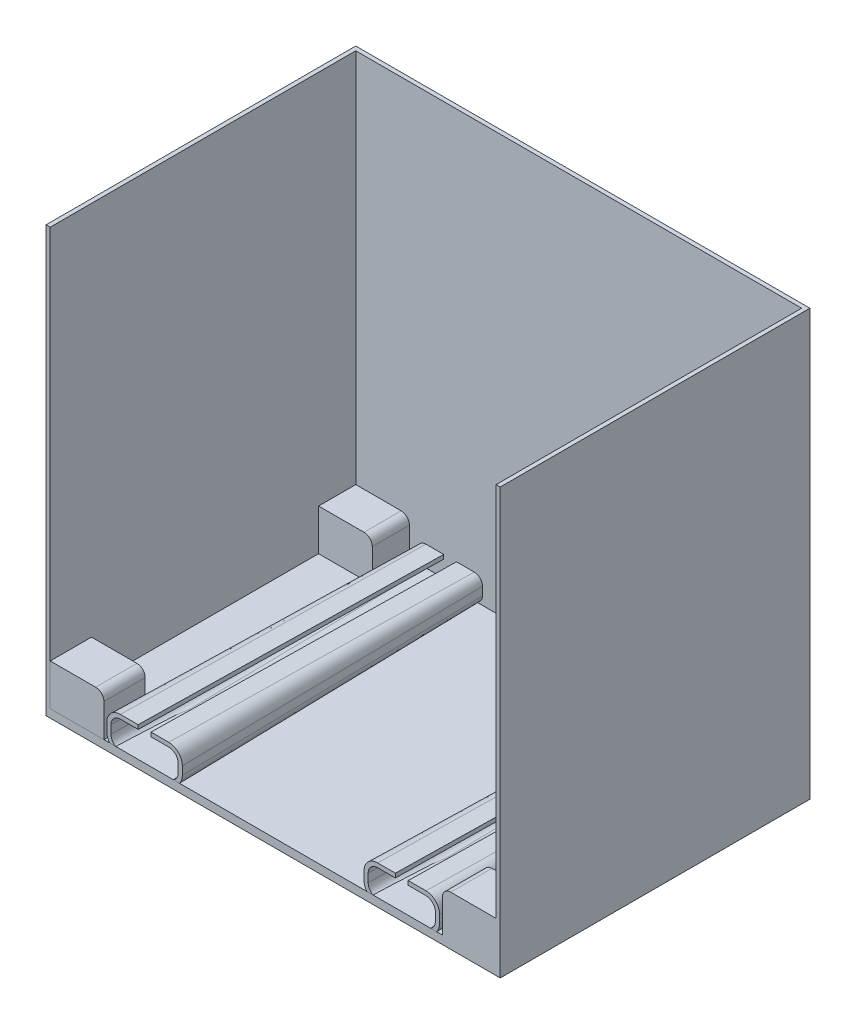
ISO-10303-21;
HEADER;
FILE_DESCRIPTION(('STEP AP214'),'2;1');
FILE_NAME('part.step','',(''),(''),'','','');
FILE_SCHEMA(('AUTOMOTIVE_DESIGN { 1 0 10303 214 1 1 1 1 }'));
ENDSEC;
DATA;
#1=APPLICATION_CONTEXT('core data for automotive mechanical design processes');
#2=APPLICATION_PROTOCOL_DEFINITION('international standard','automotive_design',2000,#1);
#3=PRODUCT_CONTEXT('',#1,'mechanical');
#4=PRODUCT('Part','Part','',(#3));
#5=PRODUCT_RELATED_PRODUCT_CATEGORY('part','',(#4));
#6=PRODUCT_DEFINITION_FORMATION('','',#4);
#7=PRODUCT_DEFINITION_CONTEXT('part definition',#1,'design');
#8=PRODUCT_DEFINITION('design','',#6,#7);
#9=PRODUCT_DEFINITION_SHAPE('','',#8);
#10=(LENGTH_UNIT() NAMED_UNIT(*) SI_UNIT(.MILLI.,.METRE.));
#11=(NAMED_UNIT(*) PLANE_ANGLE_UNIT() SI_UNIT($,.RADIAN.));
#12=(NAMED_UNIT(*) SI_UNIT($,.STERADIAN.) SOLID_ANGLE_UNIT());
#13=UNCERTAINTY_MEASURE_WITH_UNIT(LENGTH_MEASURE(1.E-05),#10,'distance_accuracy_value','');
#14=(GEOMETRIC_REPRESENTATION_CONTEXT(3) GLOBAL_UNCERTAINTY_ASSIGNED_CONTEXT((#13)) GLOBAL_UNIT_ASSIGNED_CONTEXT((#10,
#11,#12)) REPRESENTATION_CONTEXT('',''));
#15=CARTESIAN_POINT('',(0.,0.,0.));
#16=DIRECTION('',(0.,0.,1.));
#17=DIRECTION('',(1.,0.,0.));
#18=AXIS2_PLACEMENT_3D('',#15,#16,#17);
#19=CARTESIAN_POINT('',(-54.,-49.5,27.5));
#20=DIRECTION('',(-1.,0.,0.));
#21=DIRECTION('',(0.,0.,1.));
#22=AXIS2_PLACEMENT_3D('',#19,#20,#21);
#23=PLANE('',#22);
#24=DIRECTION('',(0.,-1.,0.));
#25=VECTOR('',#24,1.);
#26=CARTESIAN_POINT('',(-54.,-49.5,37.5));
#27=LINE('',#26,#25);
#28=CARTESIAN_POINT('',(-54.,-39.5,37.5));
#29=VERTEX_POINT('',#28);
#30=CARTESIAN_POINT('',(-54.,-49.5,37.5));
#31=VERTEX_POINT('',#30);
#32=EDGE_CURVE('E134',#29,#31,#27,.T.);
#33=ORIENTED_EDGE('',*,*,#32,.F.);
#34=DIRECTION('',(0.,0.,1.));
#35=VECTOR('',#34,1.);
#36=CARTESIAN_POINT('',(-54.,-39.5,27.5));
#37=LINE('',#36,#35);
#38=CARTESIAN_POINT('',(-54.,-39.5,27.5));
#39=VERTEX_POINT('',#38);
#40=EDGE_CURVE('E12',#39,#29,#37,.T.);
#41=ORIENTED_EDGE('',*,*,#40,.F.);
#42=DIRECTION('',(0.,-1.,0.));
#43=VECTOR('',#42,1.);
#44=CARTESIAN_POINT('',(-54.,-49.5,27.5));
#45=LINE('',#44,#43);
#46=CARTESIAN_POINT('',(-54.,-49.5,27.5));
#47=VERTEX_POINT('',#46);
#48=EDGE_CURVE('E129',#39,#47,#45,.T.);
#49=ORIENTED_EDGE('',*,*,#48,.T.);
#50=DIRECTION('',(0.,0.,1.));
#51=VECTOR('',#50,1.);
#52=CARTESIAN_POINT('',(-54.,-49.5,27.5));
#53=LINE('',#52,#51);
#54=EDGE_CURVE('E102',#47,#31,#53,.T.);
#55=ORIENTED_EDGE('',*,*,#54,.T.);
#56=EDGE_LOOP('',(#33,#41,#49,#55));
#57=FACE_BOUND('',#56,.T.);
#58=ADVANCED_FACE('F54',(#57),#23,.T.);
#59=CARTESIAN_POINT('',(-54.,-39.5,27.5));
#60=DIRECTION('',(0.,1.,0.));
#61=DIRECTION('',(0.,0.,1.));
#62=AXIS2_PLACEMENT_3D('',#59,#60,#61);
#63=PLANE('',#62);
#64=DIRECTION('',(-1.,0.,0.));
#65=VECTOR('',#64,1.);
#66=CARTESIAN_POINT('',(-54.,-39.5,37.5));
#67=LINE('',#66,#65);
#68=CARTESIAN_POINT('',(-43.,-39.5,37.5));
#69=VERTEX_POINT('',#68);
#70=EDGE_CURVE('E143',#69,#29,#67,.T.);
#71=ORIENTED_EDGE('',*,*,#70,.F.);
#72=DIRECTION('',(0.,0.,1.));
#73=VECTOR('',#72,1.);
#74=CARTESIAN_POINT('',(-43.,-39.5,27.5));
#75=LINE('',#74,#73);
#76=CARTESIAN_POINT('',(-43.,-39.5,27.5));
#77=VERTEX_POINT('',#76);
#78=EDGE_CURVE('E63',#77,#69,#75,.T.);
#79=ORIENTED_EDGE('',*,*,#78,.F.);
#80=DIRECTION('',(-1.,0.,0.));
#81=VECTOR('',#80,1.);
#82=CARTESIAN_POINT('',(-54.,-39.5,27.5));
#83=LINE('',#82,#81);
#84=EDGE_CURVE('E124',#77,#39,#83,.T.);
#85=ORIENTED_EDGE('',*,*,#84,.T.);
#86=ORIENTED_EDGE('',*,*,#40,.T.);
#87=EDGE_LOOP('',(#71,#79,#85,#86));
#88=FACE_BOUND('',#87,.T.);
#89=ADVANCED_FACE('F150',(#88),#63,.T.);
#90=CARTESIAN_POINT('',(-43.,-41.5,27.5));
#91=DIRECTION('',(0.,0.,1.));
#92=DIRECTION('',(1.,0.,0.));
#93=AXIS2_PLACEMENT_3D('',#90,#91,#92);
#94=CYLINDRICAL_SURFACE('',#93,2.);
#95=CARTESIAN_POINT('',(-43.,-41.5,37.5));
#96=DIRECTION('',(0.,0.,1.));
#97=DIRECTION('',(-1.,0.,0.));
#98=AXIS2_PLACEMENT_3D('',#95,#96,#97);
#99=CIRCLE('',#98,2.);
#100=CARTESIAN_POINT('',(-41.,-41.5,37.5));
#101=VERTEX_POINT('',#100);
#102=EDGE_CURVE('E113',#101,#69,#99,.T.);
#103=ORIENTED_EDGE('',*,*,#102,.F.);
#104=DIRECTION('',(0.,0.,1.));
#105=VECTOR('',#104,1.);
#106=CARTESIAN_POINT('',(-41.,-41.5,27.5));
#107=LINE('',#106,#105);
#108=CARTESIAN_POINT('',(-41.,-41.5,27.5));
#109=VERTEX_POINT('',#108);
#110=EDGE_CURVE('E108',#109,#101,#107,.T.);
#111=ORIENTED_EDGE('',*,*,#110,.F.);
#112=CARTESIAN_POINT('',(-43.,-41.5,27.5));
#113=DIRECTION('',(0.,0.,1.));
#114=DIRECTION('',(-1.,0.,0.));
#115=AXIS2_PLACEMENT_3D('',#112,#113,#114);
#116=CIRCLE('',#115,2.);
#117=EDGE_CURVE('E111',#109,#77,#116,.T.);
#118=ORIENTED_EDGE('',*,*,#117,.T.);
#119=ORIENTED_EDGE('',*,*,#78,.T.);
#120=EDGE_LOOP('',(#103,#111,#118,#119));
#121=FACE_BOUND('',#120,.T.);
#122=ADVANCED_FACE('F110',(#121),#94,.T.);
#123=CARTESIAN_POINT('',(-41.,-49.5,27.5));
#124=DIRECTION('',(1.,0.,0.));
#125=DIRECTION('',(0.,0.,-1.));
#126=AXIS2_PLACEMENT_3D('',#123,#124,#125);
#127=PLANE('',#126);
#128=DIRECTION('',(0.,1.,0.));
#129=VECTOR('',#128,1.);
#130=CARTESIAN_POINT('',(-41.,-49.5,37.5));
#131=LINE('',#130,#129);
#132=CARTESIAN_POINT('',(-41.,-49.5,37.5));
#133=VERTEX_POINT('',#132);
#134=EDGE_CURVE('E140',#133,#101,#131,.T.);
#135=ORIENTED_EDGE('',*,*,#134,.F.);
#136=DIRECTION('',(0.,0.,1.));
#137=VECTOR('',#136,1.);
#138=CARTESIAN_POINT('',(-41.,-49.5,27.5));
#139=LINE('',#138,#137);
#140=CARTESIAN_POINT('',(-41.,-49.5,27.5));
#141=VERTEX_POINT('',#140);
#142=EDGE_CURVE('E118',#141,#133,#139,.T.);
#143=ORIENTED_EDGE('',*,*,#142,.F.);
#144=DIRECTION('',(0.,1.,0.));
#145=VECTOR('',#144,1.);
#146=CARTESIAN_POINT('',(-41.,-49.5,27.5));
#147=LINE('',#146,#145);
#148=EDGE_CURVE('E123',#141,#109,#147,.T.);
#149=ORIENTED_EDGE('',*,*,#148,.T.);
#150=ORIENTED_EDGE('',*,*,#110,.T.);
#151=EDGE_LOOP('',(#135,#143,#149,#150));
#152=FACE_BOUND('',#151,.T.);
#153=ADVANCED_FACE('F126',(#152),#127,.T.);
#154=CARTESIAN_POINT('',(-54.,-49.5,27.5));
#155=DIRECTION('',(0.,-1.,0.));
#156=DIRECTION('',(0.,0.,-1.));
#157=AXIS2_PLACEMENT_3D('',#154,#155,#156);
#158=PLANE('',#157);
#159=CARTESIAN_POINT('',(-47.,-49.5,31.5));
#160=DIRECTION('',(0.,-1.,0.));
#161=DIRECTION('',(0.,0.,-1.));
#162=AXIS2_PLACEMENT_3D('',#159,#160,#161);
#163=CIRCLE('',#162,2.5908);
#164=CARTESIAN_POINT('',(-47.,-49.5,28.9092));
#165=VERTEX_POINT('',#164);
#166=EDGE_CURVE('E57',#165,#165,#163,.T.);
#167=ORIENTED_EDGE('',*,*,#166,.F.);
#168=EDGE_LOOP('',(#167));
#169=FACE_BOUND('',#168,.T.);
#170=DIRECTION('',(1.,0.,0.));
#171=VECTOR('',#170,1.);
#172=CARTESIAN_POINT('',(-54.,-49.5,37.5));
#173=LINE('',#172,#171);
#174=EDGE_CURVE('E137',#31,#133,#173,.T.);
#175=ORIENTED_EDGE('',*,*,#174,.F.);
#176=ORIENTED_EDGE('',*,*,#54,.F.);
#177=DIRECTION('',(1.,0.,0.));
#178=VECTOR('',#177,1.);
#179=CARTESIAN_POINT('',(-54.,-49.5,27.5));
#180=LINE('',#179,#178);
#181=EDGE_CURVE('E127',#47,#141,#180,.T.);
#182=ORIENTED_EDGE('',*,*,#181,.T.);
#183=ORIENTED_EDGE('',*,*,#142,.T.);
#184=EDGE_LOOP('',(#175,#176,#182,#183));
#185=FACE_BOUND('',#184,.T.);
#186=ADVANCED_FACE('F147',(#169,#185),#158,.T.);
#187=CARTESIAN_POINT('',(-43.,-41.5,27.5));
#188=DIRECTION('',(0.,0.,-1.));
#189=DIRECTION('',(-1.,0.,0.));
#190=AXIS2_PLACEMENT_3D('',#187,#188,#189);
#191=PLANE('',#190);
#192=ORIENTED_EDGE('',*,*,#48,.F.);
#193=ORIENTED_EDGE('',*,*,#84,.F.);
#194=ORIENTED_EDGE('',*,*,#117,.F.);
#195=ORIENTED_EDGE('',*,*,#148,.F.);
#196=ORIENTED_EDGE('',*,*,#181,.F.);
#197=EDGE_LOOP('',(#192,#193,#194,#195,#196));
#198=FACE_BOUND('',#197,.T.);
#199=ADVANCED_FACE('F122',(#198),#191,.T.);
#200=CARTESIAN_POINT('',(-43.,-41.5,37.5));
#201=DIRECTION('',(0.,0.,-1.));
#202=DIRECTION('',(-1.,0.,0.));
#203=AXIS2_PLACEMENT_3D('',#200,#201,#202);
#204=PLANE('',#203);
#205=ORIENTED_EDGE('',*,*,#32,.T.);
#206=ORIENTED_EDGE('',*,*,#174,.T.);
#207=ORIENTED_EDGE('',*,*,#134,.T.);
#208=ORIENTED_EDGE('',*,*,#102,.T.);
#209=ORIENTED_EDGE('',*,*,#70,.T.);
#210=EDGE_LOOP('',(#205,#206,#207,#208,#209));
#211=FACE_BOUND('',#210,.T.);
#212=ADVANCED_FACE('F149',(#211),#204,.F.);
#213=CARTESIAN_POINT('',(-47.,-45.0567096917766,31.5));
#214=DIRECTION('',(0.,-1.,0.));
#215=DIRECTION('',(0.,0.,-1.));
#216=AXIS2_PLACEMENT_3D('',#213,#214,#215);
#217=CONICAL_SURFACE('',#216,2.5908,1.02974425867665);
#218=CARTESIAN_POINT('',(-47.,-43.5,31.5));
#219=VERTEX_POINT('',#218);
#220=VERTEX_LOOP('',#219);
#221=FACE_BOUND('',#220,.T.);
#222=CARTESIAN_POINT('',(-47.,-45.0567096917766,31.5));
#223=DIRECTION('',(0.,-1.,0.));
#224=DIRECTION('',(0.,0.,-1.));
#225=AXIS2_PLACEMENT_3D('',#222,#223,#224);
#226=CIRCLE('',#225,2.5908);
#227=CARTESIAN_POINT('',(-47.,-45.0567096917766,28.9092));
#228=VERTEX_POINT('',#227);
#229=EDGE_CURVE('E170',#228,#228,#226,.T.);
#230=ORIENTED_EDGE('',*,*,#229,.T.);
#231=EDGE_LOOP('',(#230));
#232=FACE_BOUND('',#231,.T.);
#233=ADVANCED_FACE('F175',(#221,#232),#217,.F.);
#234=CARTESIAN_POINT('',(-47.,-51.5,31.5));
#235=DIRECTION('',(0.,-1.,0.));
#236=DIRECTION('',(0.,0.,-1.));
#237=AXIS2_PLACEMENT_3D('',#234,#235,#236);
#238=CYLINDRICAL_SURFACE('',#237,2.5908);
#239=ORIENTED_EDGE('',*,*,#166,.T.);
#240=EDGE_LOOP('',(#239));
#241=FACE_BOUND('',#240,.T.);
#242=ORIENTED_EDGE('',*,*,#229,.F.);
#243=EDGE_LOOP('',(#242));
#244=FACE_BOUND('',#243,.T.);
#245=ADVANCED_FACE('F177',(#241,#244),#238,.F.);
#246=CLOSED_SHELL('',(#58,#89,#122,#153,#186,#199,#212,#233,#245));
#247=MANIFOLD_SOLID_BREP('B2',#246);
#248=CARTESIAN_POINT('',(37.,-44.5,-36.5));
#249=DIRECTION('',(0.,0.999847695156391,-0.0174524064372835));
#250=DIRECTION('',(0.,0.0174524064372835,0.999847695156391));
#251=AXIS2_PLACEMENT_3D('',#248,#249,#250);
#252=PLANE('',#251);
#253=DIRECTION('',(0.,-0.0174524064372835,-0.999847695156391));
#254=VECTOR('',#253,1.);
#255=CARTESIAN_POINT('',(32.7,-44.5,-36.5));
#256=LINE('',#255,#254);
#257=CARTESIAN_POINT('',(32.7,-44.5,-36.5));
#258=VERTEX_POINT('',#257);
#259=CARTESIAN_POINT('',(32.7,-43.2083251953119,37.5));
#260=VERTEX_POINT('',#259);
#261=EDGE_CURVE('E52',#258,#260,#256,.F.);
#262=ORIENTED_EDGE('',*,*,#261,.F.);
#263=DIRECTION('',(-1.,0.,0.));
#264=VECTOR('',#263,1.);
#265=CARTESIAN_POINT('',(37.,-44.5,-36.5));
#266=LINE('',#265,#264);
#267=CARTESIAN_POINT('',(37.,-44.5,-36.5));
#268=VERTEX_POINT('',#267);
#269=EDGE_CURVE('E420',#268,#258,#266,.T.);
#270=ORIENTED_EDGE('',*,*,#269,.F.);
#271=DIRECTION('',(0.,0.0174524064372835,0.999847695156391));
#272=VECTOR('',#271,1.);
#273=CARTESIAN_POINT('',(37.,-44.5,-36.5));
#274=LINE('',#273,#272);
#275=CARTESIAN_POINT('',(37.,-43.2083251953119,37.5));
#276=VERTEX_POINT('',#275);
#277=EDGE_CURVE('E434',#276,#268,#274,.F.);
#278=ORIENTED_EDGE('',*,*,#277,.F.);
#279=DIRECTION('',(-1.,0.,0.));
#280=VECTOR('',#279,1.);
#281=CARTESIAN_POINT('',(37.,-43.2083251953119,37.5));
#282=LINE('',#281,#280);
#283=EDGE_CURVE('E476',#260,#276,#282,.F.);
#284=ORIENTED_EDGE('',*,*,#283,.F.);
#285=EDGE_LOOP('',(#262,#270,#278,#284));
#286=FACE_BOUND('',#285,.T.);
#287=ADVANCED_FACE('F266',(#286),#252,.F.);
#288=CARTESIAN_POINT('',(37.,-45.5,-37.5));
#289=DIRECTION('',(0.,0.,1.));
#290=DIRECTION('',(1.,0.,0.));
#291=AXIS2_PLACEMENT_3D('',#288,#289,#290);
#292=PLANE('',#291);
#293=CARTESIAN_POINT('',(37.,-45.5,-37.5));
#294=DIRECTION('',(0.,0.,1.));
#295=DIRECTION('',(1.,0.,0.));
#296=AXIS2_PLACEMENT_3D('',#293,#294,#295);
#297=CIRCLE('',#296,1.98269726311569);
#298=CARTESIAN_POINT('',(38.9826972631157,-45.5,-37.5));
#299=VERTEX_POINT('',#298);
#300=CARTESIAN_POINT('',(37.,-43.5173027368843,-37.5));
#301=VERTEX_POINT('',#300);
#302=EDGE_CURVE('E494',#299,#301,#297,.T.);
#303=ORIENTED_EDGE('',*,*,#302,.F.);
#304=DIRECTION('',(0.,-1.,0.));
#305=VECTOR('',#304,1.);
#306=CARTESIAN_POINT('',(38.9826972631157,-47.5,-37.5));
#307=LINE('',#306,#305);
#308=CARTESIAN_POINT('',(38.9826972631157,-47.5,-37.5));
#309=VERTEX_POINT('',#308);
#310=EDGE_CURVE('E498',#309,#299,#307,.F.);
#311=ORIENTED_EDGE('',*,*,#310,.F.);
#312=CARTESIAN_POINT('',(37.,-47.5,-37.5));
#313=DIRECTION('',(0.,0.,1.));
#314=DIRECTION('',(1.,0.,0.));
#315=AXIS2_PLACEMENT_3D('',#312,#313,#314);
#316=CIRCLE('',#315,1.98269726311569);
#317=CARTESIAN_POINT('',(37.,-49.4826972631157,-37.5));
#318=VERTEX_POINT('',#317);
#319=EDGE_CURVE('E501',#318,#309,#316,.T.);
#320=ORIENTED_EDGE('',*,*,#319,.F.);
#321=DIRECTION('',(-1.,0.,0.));
#322=VECTOR('',#321,1.);
#323=CARTESIAN_POINT('',(37.,-49.4826972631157,-37.5));
#324=LINE('',#323,#322);
#325=CARTESIAN_POINT('',(25.3,-49.4826972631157,-37.5));
#326=VERTEX_POINT('',#325);
#327=EDGE_CURVE('E505',#326,#318,#324,.F.);
#328=ORIENTED_EDGE('',*,*,#327,.F.);
#329=CARTESIAN_POINT('',(25.3,-47.5,-37.5));
#330=DIRECTION('',(0.,0.,1.));
#331=DIRECTION('',(1.,0.,0.));
#332=AXIS2_PLACEMENT_3D('',#329,#330,#331);
#333=CIRCLE('',#332,1.98269726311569);
#334=CARTESIAN_POINT('',(23.3173027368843,-47.5,-37.5));
#335=VERTEX_POINT('',#334);
#336=EDGE_CURVE('E508',#335,#326,#333,.T.);
#337=ORIENTED_EDGE('',*,*,#336,.F.);
#338=DIRECTION('',(0.,1.,0.));
#339=VECTOR('',#338,1.);
#340=CARTESIAN_POINT('',(23.3173027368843,-47.5,-37.5));
#341=LINE('',#340,#339);
#342=CARTESIAN_POINT('',(23.3173027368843,-45.5,-37.5));
#343=VERTEX_POINT('',#342);
#344=EDGE_CURVE('E511',#343,#335,#341,.F.);
#345=ORIENTED_EDGE('',*,*,#344,.F.);
#346=CARTESIAN_POINT('',(25.3,-45.5,-37.5));
#347=DIRECTION('',(0.,0.,1.));
#348=DIRECTION('',(1.,0.,0.));
#349=AXIS2_PLACEMENT_3D('',#346,#347,#348);
#350=CIRCLE('',#349,1.98269726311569);
#351=CARTESIAN_POINT('',(25.3,-43.5173027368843,-37.5));
#352=VERTEX_POINT('',#351);
#353=EDGE_CURVE('E514',#352,#343,#350,.T.);
#354=ORIENTED_EDGE('',*,*,#353,.F.);
#355=DIRECTION('',(1.,0.,0.));
#356=VECTOR('',#355,1.);
#357=CARTESIAN_POINT('',(37.,-43.5173027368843,-37.5));
#358=LINE('',#357,#356);
#359=EDGE_CURVE('E497',#301,#352,#358,.F.);
#360=ORIENTED_EDGE('',*,*,#359,.F.);
#361=EDGE_LOOP('',(#303,#311,#320,#328,#337,#345,#354,#360));
#362=FACE_BOUND('',#361,.T.);
#363=ADVANCED_FACE('F600',(#362),#292,.F.);
#364=CARTESIAN_POINT('',(38.9998476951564,-47.5,-36.5174524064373));
#365=DIRECTION('',(0.999847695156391,0.,-0.0174524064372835));
#366=DIRECTION('',(-0.0174524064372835,0.,-0.999847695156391));
#367=AXIS2_PLACEMENT_3D('',#364,#365,#366);
#368=PLANE('',#367);
#369=DIRECTION('',(0.0174524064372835,0.,0.999847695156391));
#370=VECTOR('',#369,1.);
#371=CARTESIAN_POINT('',(38.9998476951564,-45.5,-36.5174524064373));
#372=LINE('',#371,#370);
#373=CARTESIAN_POINT('',(40.291827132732,-45.5,37.5));
#374=VERTEX_POINT('',#373);
#375=EDGE_CURVE('E502',#374,#299,#372,.F.);
#376=ORIENTED_EDGE('',*,*,#375,.F.);
#377=DIRECTION('',(0.,1.,0.));
#378=VECTOR('',#377,1.);
#379=CARTESIAN_POINT('',(40.291827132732,-47.5,37.5));
#380=LINE('',#379,#378);
#381=CARTESIAN_POINT('',(40.291827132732,-47.5,37.5));
#382=VERTEX_POINT('',#381);
#383=EDGE_CURVE('E534',#374,#382,#380,.F.);
#384=ORIENTED_EDGE('',*,*,#383,.T.);
#385=DIRECTION('',(-0.0174524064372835,0.,-0.999847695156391));
#386=VECTOR('',#385,1.);
#387=CARTESIAN_POINT('',(38.9998476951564,-47.5,-36.5174524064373));
#388=LINE('',#387,#386);
#389=EDGE_CURVE('E520',#382,#309,#388,.T.);
#390=ORIENTED_EDGE('',*,*,#389,.T.);
#391=ORIENTED_EDGE('',*,*,#310,.T.);
#392=EDGE_LOOP('',(#376,#384,#390,#391));
#393=FACE_BOUND('',#392,.T.);
#394=ADVANCED_FACE('F605',(#393),#368,.T.);
#395=CARTESIAN_POINT('',(37.,-47.5,-36.5174524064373));
#396=DIRECTION('',(0.,0.,1.));
#397=DIRECTION('',(1.,0.,0.));
#398=AXIS2_PLACEMENT_3D('',#395,#396,#397);
#399=CONICAL_SURFACE('',#398,1.99984769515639,0.0174532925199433);
#400=ORIENTED_EDGE('',*,*,#389,.F.);
#401=CARTESIAN_POINT('',(37.,-47.5,37.5));
#402=DIRECTION('',(0.,0.,-1.));
#403=DIRECTION('',(-1.,0.,0.));
#404=AXIS2_PLACEMENT_3D('',#401,#402,#403);
#405=CIRCLE('',#404,3.29182713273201);
#406=CARTESIAN_POINT('',(37.,-50.791827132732,37.5));
#407=VERTEX_POINT('',#406);
#408=EDGE_CURVE('E537',#382,#407,#405,.T.);
#409=ORIENTED_EDGE('',*,*,#408,.T.);
#410=DIRECTION('',(0.,-0.0174524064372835,0.999847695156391));
#411=VECTOR('',#410,1.);
#412=CARTESIAN_POINT('',(37.,-49.4998476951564,-36.5174524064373));
#413=LINE('',#412,#411);
#414=EDGE_CURVE('E522',#407,#318,#413,.F.);
#415=ORIENTED_EDGE('',*,*,#414,.T.);
#416=ORIENTED_EDGE('',*,*,#319,.T.);
#417=EDGE_LOOP('',(#400,#409,#415,#416));
#418=FACE_BOUND('',#417,.T.);
#419=ADVANCED_FACE('F611',(#418),#399,.T.);
#420=CARTESIAN_POINT('',(37.,-49.4998476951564,-36.5174524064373));
#421=DIRECTION('',(0.,-0.999847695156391,-0.0174524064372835));
#422=DIRECTION('',(0.,0.0174524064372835,-0.999847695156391));
#423=AXIS2_PLACEMENT_3D('',#420,#421,#422);
#424=PLANE('',#423);
#425=ORIENTED_EDGE('',*,*,#414,.F.);
#426=DIRECTION('',(1.,0.,0.));
#427=VECTOR('',#426,1.);
#428=CARTESIAN_POINT('',(37.,-50.791827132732,37.5));
#429=LINE('',#428,#427);
#430=CARTESIAN_POINT('',(25.3,-50.791827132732,37.5));
#431=VERTEX_POINT('',#430);
#432=EDGE_CURVE('E552',#407,#431,#429,.F.);
#433=ORIENTED_EDGE('',*,*,#432,.T.);
#434=DIRECTION('',(0.,0.0174524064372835,-0.999847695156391));
#435=VECTOR('',#434,1.);
#436=CARTESIAN_POINT('',(25.3,-49.4998476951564,-36.5174524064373));
#437=LINE('',#436,#435);
#438=EDGE_CURVE('E524',#431,#326,#437,.T.);
#439=ORIENTED_EDGE('',*,*,#438,.T.);
#440=ORIENTED_EDGE('',*,*,#327,.T.);
#441=EDGE_LOOP('',(#425,#433,#439,#440));
#442=FACE_BOUND('',#441,.T.);
#443=ADVANCED_FACE('F614',(#442),#424,.T.);
#444=CARTESIAN_POINT('',(25.3,-47.5,-36.5174524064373));
#445=DIRECTION('',(0.,0.,1.));
#446=DIRECTION('',(-1.,0.,0.));
#447=AXIS2_PLACEMENT_3D('',#444,#445,#446);
#448=CONICAL_SURFACE('',#447,1.99984769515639,0.0174532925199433);
#449=ORIENTED_EDGE('',*,*,#438,.F.);
#450=CARTESIAN_POINT('',(25.3,-47.5,37.5));
#451=DIRECTION('',(0.,0.,-1.));
#452=DIRECTION('',(-1.,0.,0.));
#453=AXIS2_PLACEMENT_3D('',#450,#451,#452);
#454=CIRCLE('',#453,3.29182713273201);
#455=CARTESIAN_POINT('',(22.008172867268,-47.5,37.5));
#456=VERTEX_POINT('',#455);
#457=EDGE_CURVE('E549',#431,#456,#454,.T.);
#458=ORIENTED_EDGE('',*,*,#457,.T.);
#459=DIRECTION('',(-0.0174524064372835,0.,0.999847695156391));
#460=VECTOR('',#459,1.);
#461=CARTESIAN_POINT('',(23.3001523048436,-47.5,-36.5174524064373));
#462=LINE('',#461,#460);
#463=EDGE_CURVE('E526',#456,#335,#462,.F.);
#464=ORIENTED_EDGE('',*,*,#463,.T.);
#465=ORIENTED_EDGE('',*,*,#336,.T.);
#466=EDGE_LOOP('',(#449,#458,#464,#465));
#467=FACE_BOUND('',#466,.T.);
#468=ADVANCED_FACE('F617',(#467),#448,.T.);
#469=CARTESIAN_POINT('',(23.3001523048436,-47.5,-36.5174524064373));
#470=DIRECTION('',(-0.999847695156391,0.,-0.0174524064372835));
#471=DIRECTION('',(-0.0174524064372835,0.,0.999847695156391));
#472=AXIS2_PLACEMENT_3D('',#469,#470,#471);
#473=PLANE('',#472);
#474=ORIENTED_EDGE('',*,*,#463,.F.);
#475=DIRECTION('',(0.,-1.,0.));
#476=VECTOR('',#475,1.);
#477=CARTESIAN_POINT('',(22.008172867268,-47.5,37.5));
#478=LINE('',#477,#476);
#479=CARTESIAN_POINT('',(22.008172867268,-45.5,37.5));
#480=VERTEX_POINT('',#479);
#481=EDGE_CURVE('E546',#456,#480,#478,.F.);
#482=ORIENTED_EDGE('',*,*,#481,.T.);
#483=DIRECTION('',(-0.0174524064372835,0.,0.999847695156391));
#484=VECTOR('',#483,1.);
#485=CARTESIAN_POINT('',(23.3001523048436,-45.5,-36.5174524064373));
#486=LINE('',#485,#484);
#487=EDGE_CURVE('E528',#480,#343,#486,.F.);
#488=ORIENTED_EDGE('',*,*,#487,.T.);
#489=ORIENTED_EDGE('',*,*,#344,.T.);
#490=EDGE_LOOP('',(#474,#482,#488,#489));
#491=FACE_BOUND('',#490,.T.);
#492=ADVANCED_FACE('F620',(#491),#473,.T.);
#493=CARTESIAN_POINT('',(25.3,-45.5,-36.5174524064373));
#494=DIRECTION('',(0.,0.,1.));
#495=DIRECTION('',(1.,0.,0.));
#496=AXIS2_PLACEMENT_3D('',#493,#494,#495);
#497=CONICAL_SURFACE('',#496,1.99984769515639,0.0174532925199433);
#498=ORIENTED_EDGE('',*,*,#487,.F.);
#499=CARTESIAN_POINT('',(25.3,-45.5,37.5));
#500=DIRECTION('',(0.,0.,-1.));
#501=DIRECTION('',(-1.,0.,0.));
#502=AXIS2_PLACEMENT_3D('',#499,#500,#501);
#503=CIRCLE('',#502,3.29182713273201);
#504=CARTESIAN_POINT('',(25.3,-42.208172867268,37.5));
#505=VERTEX_POINT('',#504);
#506=EDGE_CURVE('E543',#480,#505,#503,.T.);
#507=ORIENTED_EDGE('',*,*,#506,.T.);
#508=DIRECTION('',(0.,0.0174524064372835,0.999847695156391));
#509=VECTOR('',#508,1.);
#510=CARTESIAN_POINT('',(25.3,-43.5001523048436,-36.5174524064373));
#511=LINE('',#510,#509);
#512=EDGE_CURVE('E530',#505,#352,#511,.F.);
#513=ORIENTED_EDGE('',*,*,#512,.T.);
#514=ORIENTED_EDGE('',*,*,#353,.T.);
#515=EDGE_LOOP('',(#498,#507,#513,#514));
#516=FACE_BOUND('',#515,.T.);
#517=ADVANCED_FACE('F623',(#516),#497,.T.);
#518=CARTESIAN_POINT('',(37.,-43.5001523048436,-36.5174524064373));
#519=DIRECTION('',(0.,0.999847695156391,-0.0174524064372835));
#520=DIRECTION('',(0.,0.0174524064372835,0.999847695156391));
#521=AXIS2_PLACEMENT_3D('',#518,#519,#520);
#522=PLANE('',#521);
#523=DIRECTION('',(1.,0.,0.));
#524=VECTOR('',#523,1.);
#525=CARTESIAN_POINT('',(37.,-43.4998476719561,-36.5));
#526=LINE('',#525,#524);
#527=CARTESIAN_POINT('',(32.7,-43.4998476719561,-36.5));
#528=VERTEX_POINT('',#527);
#529=CARTESIAN_POINT('',(29.6,-43.4998476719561,-36.5));
#530=VERTEX_POINT('',#529);
#531=EDGE_CURVE('E417',#528,#530,#526,.F.);
#532=ORIENTED_EDGE('',*,*,#531,.F.);
#533=DIRECTION('',(0.,-0.0174524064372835,-0.999847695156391));
#534=VECTOR('',#533,1.);
#535=CARTESIAN_POINT('',(32.7,-43.5001523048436,-36.5174524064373));
#536=LINE('',#535,#534);
#537=CARTESIAN_POINT('',(32.7,-42.208172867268,37.5));
#538=VERTEX_POINT('',#537);
#539=EDGE_CURVE('E402',#528,#538,#536,.F.);
#540=ORIENTED_EDGE('',*,*,#539,.T.);
#541=DIRECTION('',(-1.,0.,0.));
#542=VECTOR('',#541,1.);
#543=CARTESIAN_POINT('',(37.,-42.208172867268,37.5));
#544=LINE('',#543,#542);
#545=CARTESIAN_POINT('',(37.,-42.208172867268,37.5));
#546=VERTEX_POINT('',#545);
#547=EDGE_CURVE('E540',#538,#546,#544,.F.);
#548=ORIENTED_EDGE('',*,*,#547,.T.);
#549=DIRECTION('',(0.,0.0174524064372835,0.999847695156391));
#550=VECTOR('',#549,1.);
#551=CARTESIAN_POINT('',(37.,-43.5001523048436,-36.5174524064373));
#552=LINE('',#551,#550);
#553=EDGE_CURVE('E532',#546,#301,#552,.F.);
#554=ORIENTED_EDGE('',*,*,#553,.T.);
#555=ORIENTED_EDGE('',*,*,#359,.T.);
#556=ORIENTED_EDGE('',*,*,#512,.F.);
#557=CARTESIAN_POINT('',(29.6,-42.208172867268,37.5));
#558=VERTEX_POINT('',#557);
#559=EDGE_CURVE('E541',#505,#558,#544,.F.);
#560=ORIENTED_EDGE('',*,*,#559,.T.);
#561=DIRECTION('',(0.,0.0174524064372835,0.999847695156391));
#562=VECTOR('',#561,1.);
#563=CARTESIAN_POINT('',(29.6,-43.5001523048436,-36.5174524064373));
#564=LINE('',#563,#562);
#565=EDGE_CURVE('E413',#558,#530,#564,.F.);
#566=ORIENTED_EDGE('',*,*,#565,.T.);
#567=EDGE_LOOP('',(#532,#540,#548,#554,#555,#556,#560,#566));
#568=FACE_BOUND('',#567,.T.);
#569=ADVANCED_FACE('F423',(#568),#522,.T.);
#570=CARTESIAN_POINT('',(37.,-45.5,-36.5174524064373));
#571=DIRECTION('',(0.,0.,1.));
#572=DIRECTION('',(1.,0.,0.));
#573=AXIS2_PLACEMENT_3D('',#570,#571,#572);
#574=CONICAL_SURFACE('',#573,1.99984769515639,0.0174532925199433);
#575=ORIENTED_EDGE('',*,*,#553,.F.);
#576=CARTESIAN_POINT('',(37.,-45.5,37.5));
#577=DIRECTION('',(0.,0.,-1.));
#578=DIRECTION('',(-1.,0.,0.));
#579=AXIS2_PLACEMENT_3D('',#576,#577,#578);
#580=CIRCLE('',#579,3.29182713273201);
#581=EDGE_CURVE('E473',#546,#374,#580,.T.);
#582=ORIENTED_EDGE('',*,*,#581,.T.);
#583=ORIENTED_EDGE('',*,*,#375,.T.);
#584=ORIENTED_EDGE('',*,*,#302,.T.);
#585=EDGE_LOOP('',(#575,#582,#583,#584));
#586=FACE_BOUND('',#585,.T.);
#587=ADVANCED_FACE('F268',(#586),#574,.T.);
#588=CARTESIAN_POINT('',(-55.,51.5,37.5));
#589=DIRECTION('',(0.,0.,-1.));
#590=DIRECTION('',(-1.,0.,0.));
#591=AXIS2_PLACEMENT_3D('',#588,#589,#590);
#592=PLANE('',#591);
#593=ORIENTED_EDGE('',*,*,#547,.F.);
#594=DIRECTION('',(0.,1.,0.));
#595=VECTOR('',#594,1.);
#596=CARTESIAN_POINT('',(32.7,-44.7083251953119,37.5));
#597=LINE('',#596,#595);
#598=EDGE_CURVE('E408',#260,#538,#597,.T.);
#599=ORIENTED_EDGE('',*,*,#598,.F.);
#600=ORIENTED_EDGE('',*,*,#283,.T.);
#601=CARTESIAN_POINT('',(37.,-45.5,37.5));
#602=DIRECTION('',(0.,0.,-1.));
#603=DIRECTION('',(-1.,0.,0.));
#604=AXIS2_PLACEMENT_3D('',#601,#602,#603);
#605=CIRCLE('',#604,2.29167480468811);
#606=CARTESIAN_POINT('',(39.2916748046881,-45.5,37.5));
#607=VERTEX_POINT('',#606);
#608=EDGE_CURVE('E412',#276,#607,#605,.T.);
#609=ORIENTED_EDGE('',*,*,#608,.T.);
#610=DIRECTION('',(0.,1.,0.));
#611=VECTOR('',#610,1.);
#612=CARTESIAN_POINT('',(39.2916748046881,-47.5,37.5));
#613=LINE('',#612,#611);
#614=CARTESIAN_POINT('',(39.2916748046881,-47.5,37.5));
#615=VERTEX_POINT('',#614);
#616=EDGE_CURVE('E431',#607,#615,#613,.F.);
#617=ORIENTED_EDGE('',*,*,#616,.T.);
#618=CARTESIAN_POINT('',(37.,-47.5,37.5));
#619=DIRECTION('',(0.,0.,-1.));
#620=DIRECTION('',(-1.,0.,0.));
#621=AXIS2_PLACEMENT_3D('',#618,#619,#620);
#622=CIRCLE('',#621,2.29167480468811);
#623=CARTESIAN_POINT('',(37.,-49.7916748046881,37.5));
#624=VERTEX_POINT('',#623);
#625=EDGE_CURVE('E435',#615,#624,#622,.T.);
#626=ORIENTED_EDGE('',*,*,#625,.T.);
#627=DIRECTION('',(1.,0.,0.));
#628=VECTOR('',#627,1.);
#629=CARTESIAN_POINT('',(37.,-49.7916748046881,37.5));
#630=LINE('',#629,#628);
#631=CARTESIAN_POINT('',(25.3,-49.7916748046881,37.5));
#632=VERTEX_POINT('',#631);
#633=EDGE_CURVE('E489',#624,#632,#630,.F.);
#634=ORIENTED_EDGE('',*,*,#633,.T.);
#635=CARTESIAN_POINT('',(25.3,-47.5,37.5));
#636=DIRECTION('',(0.,0.,-1.));
#637=DIRECTION('',(-1.,0.,0.));
#638=AXIS2_PLACEMENT_3D('',#635,#636,#637);
#639=CIRCLE('',#638,2.29167480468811);
#640=CARTESIAN_POINT('',(23.0083251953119,-47.5,37.5));
#641=VERTEX_POINT('',#640);
#642=EDGE_CURVE('E486',#632,#641,#639,.T.);
#643=ORIENTED_EDGE('',*,*,#642,.T.);
#644=DIRECTION('',(0.,-1.,0.));
#645=VECTOR('',#644,1.);
#646=CARTESIAN_POINT('',(23.0083251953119,-47.5,37.5));
#647=LINE('',#646,#645);
#648=CARTESIAN_POINT('',(23.0083251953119,-45.5,37.5));
#649=VERTEX_POINT('',#648);
#650=EDGE_CURVE('E483',#641,#649,#647,.F.);
#651=ORIENTED_EDGE('',*,*,#650,.T.);
#652=CARTESIAN_POINT('',(25.3,-45.5,37.5));
#653=DIRECTION('',(0.,0.,-1.));
#654=DIRECTION('',(-1.,0.,0.));
#655=AXIS2_PLACEMENT_3D('',#652,#653,#654);
#656=CIRCLE('',#655,2.29167480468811);
#657=CARTESIAN_POINT('',(25.3,-43.2083251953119,37.5));
#658=VERTEX_POINT('',#657);
#659=EDGE_CURVE('E480',#649,#658,#656,.T.);
#660=ORIENTED_EDGE('',*,*,#659,.T.);
#661=CARTESIAN_POINT('',(29.6,-43.2083251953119,37.5));
#662=VERTEX_POINT('',#661);
#663=EDGE_CURVE('E477',#658,#662,#282,.F.);
#664=ORIENTED_EDGE('',*,*,#663,.T.);
#665=DIRECTION('',(0.,-1.,0.));
#666=VECTOR('',#665,1.);
#667=CARTESIAN_POINT('',(29.6,-44.7083251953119,37.5));
#668=LINE('',#667,#666);
#669=EDGE_CURVE('E427',#558,#662,#668,.T.);
#670=ORIENTED_EDGE('',*,*,#669,.F.);
#671=ORIENTED_EDGE('',*,*,#559,.F.);
#672=ORIENTED_EDGE('',*,*,#506,.F.);
#673=ORIENTED_EDGE('',*,*,#481,.F.);
#674=ORIENTED_EDGE('',*,*,#457,.F.);
#675=ORIENTED_EDGE('',*,*,#432,.F.);
#676=ORIENTED_EDGE('',*,*,#408,.F.);
#677=ORIENTED_EDGE('',*,*,#383,.F.);
#678=ORIENTED_EDGE('',*,*,#581,.F.);
#679=EDGE_LOOP('',(#593,#599,#600,#609,#617,#626,#634,#643,#651,#660,#664,#670,#671,#672,#673,
#674,#675,#676,#677,#678));
#680=FACE_BOUND('',#679,.T.);
#681=ADVANCED_FACE('F576',(#680),#592,.F.);
#682=CARTESIAN_POINT('',(37.,-45.5,-36.5));
#683=DIRECTION('',(0.,0.,1.));
#684=DIRECTION('',(1.,0.,0.));
#685=AXIS2_PLACEMENT_3D('',#682,#683,#684);
#686=PLANE('',#685);
#687=ORIENTED_EDGE('',*,*,#269,.T.);
#688=DIRECTION('',(0.,-1.,0.));
#689=VECTOR('',#688,1.);
#690=CARTESIAN_POINT('',(32.7,-44.7083251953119,-36.5));
#691=LINE('',#690,#689);
#692=EDGE_CURVE('E405',#528,#258,#691,.T.);
#693=ORIENTED_EDGE('',*,*,#692,.F.);
#694=ORIENTED_EDGE('',*,*,#531,.T.);
#695=DIRECTION('',(0.,1.,0.));
#696=VECTOR('',#695,1.);
#697=CARTESIAN_POINT('',(29.6,-44.7083251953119,-36.5));
#698=LINE('',#697,#696);
#699=CARTESIAN_POINT('',(29.6,-44.5,-36.5));
#700=VERTEX_POINT('',#699);
#701=EDGE_CURVE('E281',#700,#530,#698,.T.);
#702=ORIENTED_EDGE('',*,*,#701,.F.);
#703=CARTESIAN_POINT('',(25.3,-44.5,-36.5));
#704=VERTEX_POINT('',#703);
#705=EDGE_CURVE('E469',#700,#704,#266,.T.);
#706=ORIENTED_EDGE('',*,*,#705,.T.);
#707=CARTESIAN_POINT('',(25.3,-45.5,-36.5));
#708=DIRECTION('',(0.,0.,1.));
#709=DIRECTION('',(1.,0.,0.));
#710=AXIS2_PLACEMENT_3D('',#707,#708,#709);
#711=CIRCLE('',#710,1.);
#712=CARTESIAN_POINT('',(24.3,-45.5,-36.5));
#713=VERTEX_POINT('',#712);
#714=EDGE_CURVE('E466',#704,#713,#711,.T.);
#715=ORIENTED_EDGE('',*,*,#714,.T.);
#716=DIRECTION('',(0.,-1.,0.));
#717=VECTOR('',#716,1.);
#718=CARTESIAN_POINT('',(24.3,-47.5,-36.5));
#719=LINE('',#718,#717);
#720=CARTESIAN_POINT('',(24.3,-47.5,-36.5));
#721=VERTEX_POINT('',#720);
#722=EDGE_CURVE('E463',#713,#721,#719,.T.);
#723=ORIENTED_EDGE('',*,*,#722,.T.);
#724=CARTESIAN_POINT('',(25.3,-47.5,-36.5));
#725=DIRECTION('',(0.,0.,1.));
#726=DIRECTION('',(-1.,0.,0.));
#727=AXIS2_PLACEMENT_3D('',#724,#725,#726);
#728=CIRCLE('',#727,1.);
#729=CARTESIAN_POINT('',(25.3,-48.5,-36.5));
#730=VERTEX_POINT('',#729);
#731=EDGE_CURVE('E460',#721,#730,#728,.T.);
#732=ORIENTED_EDGE('',*,*,#731,.T.);
#733=DIRECTION('',(1.,0.,0.));
#734=VECTOR('',#733,1.);
#735=CARTESIAN_POINT('',(37.,-48.5,-36.5));
#736=LINE('',#735,#734);
#737=CARTESIAN_POINT('',(37.,-48.5,-36.5));
#738=VERTEX_POINT('',#737);
#739=EDGE_CURVE('E457',#730,#738,#736,.T.);
#740=ORIENTED_EDGE('',*,*,#739,.T.);
#741=CARTESIAN_POINT('',(37.,-47.5,-36.5));
#742=DIRECTION('',(0.,0.,1.));
#743=DIRECTION('',(1.,0.,0.));
#744=AXIS2_PLACEMENT_3D('',#741,#742,#743);
#745=CIRCLE('',#744,1.);
#746=CARTESIAN_POINT('',(38.,-47.5,-36.5));
#747=VERTEX_POINT('',#746);
#748=EDGE_CURVE('E454',#738,#747,#745,.T.);
#749=ORIENTED_EDGE('',*,*,#748,.T.);
#750=DIRECTION('',(0.,1.,0.));
#751=VECTOR('',#750,1.);
#752=CARTESIAN_POINT('',(38.,-47.5,-36.5));
#753=LINE('',#752,#751);
#754=CARTESIAN_POINT('',(38.,-45.5,-36.5));
#755=VERTEX_POINT('',#754);
#756=EDGE_CURVE('E450',#747,#755,#753,.T.);
#757=ORIENTED_EDGE('',*,*,#756,.T.);
#758=CARTESIAN_POINT('',(37.,-45.5,-36.5));
#759=DIRECTION('',(0.,0.,1.));
#760=DIRECTION('',(1.,0.,0.));
#761=AXIS2_PLACEMENT_3D('',#758,#759,#760);
#762=CIRCLE('',#761,1.);
#763=EDGE_CURVE('E471',#755,#268,#762,.T.);
#764=ORIENTED_EDGE('',*,*,#763,.T.);
#765=EDGE_LOOP('',(#687,#693,#694,#702,#706,#715,#723,#732,#740,#749,#757,#764));
#766=FACE_BOUND('',#765,.T.);
#767=ADVANCED_FACE('F416',(#766),#686,.T.);
#768=CARTESIAN_POINT('',(38.,-47.5,-36.5));
#769=DIRECTION('',(0.999847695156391,0.,-0.0174524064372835));
#770=DIRECTION('',(-0.0174524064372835,0.,-0.999847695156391));
#771=AXIS2_PLACEMENT_3D('',#768,#769,#770);
#772=PLANE('',#771);
#773=DIRECTION('',(0.0174524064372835,0.,0.999847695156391));
#774=VECTOR('',#773,1.);
#775=CARTESIAN_POINT('',(38.,-45.5,-36.5));
#776=LINE('',#775,#774);
#777=EDGE_CURVE('E289',#607,#755,#776,.F.);
#778=ORIENTED_EDGE('',*,*,#777,.T.);
#779=ORIENTED_EDGE('',*,*,#756,.F.);
#780=DIRECTION('',(0.0174524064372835,0.,0.999847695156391));
#781=VECTOR('',#780,1.);
#782=CARTESIAN_POINT('',(38.,-47.5,-36.5));
#783=LINE('',#782,#781);
#784=EDGE_CURVE('E447',#615,#747,#783,.F.);
#785=ORIENTED_EDGE('',*,*,#784,.F.);
#786=ORIENTED_EDGE('',*,*,#616,.F.);
#787=EDGE_LOOP('',(#778,#779,#785,#786));
#788=FACE_BOUND('',#787,.T.);
#789=ADVANCED_FACE('F587',(#788),#772,.F.);
#790=CARTESIAN_POINT('',(37.,-47.5,-36.5));
#791=DIRECTION('',(0.,0.,1.));
#792=DIRECTION('',(1.,0.,0.));
#793=AXIS2_PLACEMENT_3D('',#790,#791,#792);
#794=CONICAL_SURFACE('',#793,1.,0.0174532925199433);
#795=ORIENTED_EDGE('',*,*,#784,.T.);
#796=ORIENTED_EDGE('',*,*,#748,.F.);
#797=DIRECTION('',(0.,-0.0174524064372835,0.999847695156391));
#798=VECTOR('',#797,1.);
#799=CARTESIAN_POINT('',(37.,-48.5,-36.5));
#800=LINE('',#799,#798);
#801=EDGE_CURVE('E445',#624,#738,#800,.F.);
#802=ORIENTED_EDGE('',*,*,#801,.F.);
#803=ORIENTED_EDGE('',*,*,#625,.F.);
#804=EDGE_LOOP('',(#795,#796,#802,#803));
#805=FACE_BOUND('',#804,.T.);
#806=ADVANCED_FACE('F583',(#805),#794,.F.);
#807=CARTESIAN_POINT('',(37.,-48.5,-36.5));
#808=DIRECTION('',(0.,-0.999847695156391,-0.0174524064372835));
#809=DIRECTION('',(0.,0.0174524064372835,-0.999847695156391));
#810=AXIS2_PLACEMENT_3D('',#807,#808,#809);
#811=PLANE('',#810);
#812=ORIENTED_EDGE('',*,*,#801,.T.);
#813=ORIENTED_EDGE('',*,*,#739,.F.);
#814=DIRECTION('',(0.,-0.0174524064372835,0.999847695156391));
#815=VECTOR('',#814,1.);
#816=CARTESIAN_POINT('',(25.3,-48.5,-36.5));
#817=LINE('',#816,#815);
#818=EDGE_CURVE('E443',#632,#730,#817,.F.);
#819=ORIENTED_EDGE('',*,*,#818,.F.);
#820=ORIENTED_EDGE('',*,*,#633,.F.);
#821=EDGE_LOOP('',(#812,#813,#819,#820));
#822=FACE_BOUND('',#821,.T.);
#823=ADVANCED_FACE('F579',(#822),#811,.F.);
#824=CARTESIAN_POINT('',(25.3,-47.5,-36.5));
#825=DIRECTION('',(0.,0.,1.));
#826=DIRECTION('',(-1.,0.,0.));
#827=AXIS2_PLACEMENT_3D('',#824,#825,#826);
#828=CONICAL_SURFACE('',#827,1.,0.0174532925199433);
#829=ORIENTED_EDGE('',*,*,#818,.T.);
#830=ORIENTED_EDGE('',*,*,#731,.F.);
#831=DIRECTION('',(-0.0174524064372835,0.,0.999847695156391));
#832=VECTOR('',#831,1.);
#833=CARTESIAN_POINT('',(24.3,-47.5,-36.5));
#834=LINE('',#833,#832);
#835=EDGE_CURVE('E441',#641,#721,#834,.F.);
#836=ORIENTED_EDGE('',*,*,#835,.F.);
#837=ORIENTED_EDGE('',*,*,#642,.F.);
#838=EDGE_LOOP('',(#829,#830,#836,#837));
#839=FACE_BOUND('',#838,.T.);
#840=ADVANCED_FACE('F573',(#839),#828,.F.);
#841=CARTESIAN_POINT('',(24.3,-47.5,-36.5));
#842=DIRECTION('',(-0.999847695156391,0.,-0.0174524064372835));
#843=DIRECTION('',(-0.0174524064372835,0.,0.999847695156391));
#844=AXIS2_PLACEMENT_3D('',#841,#842,#843);
#845=PLANE('',#844);
#846=ORIENTED_EDGE('',*,*,#835,.T.);
#847=ORIENTED_EDGE('',*,*,#722,.F.);
#848=DIRECTION('',(-0.0174524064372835,0.,0.999847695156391));
#849=VECTOR('',#848,1.);
#850=CARTESIAN_POINT('',(24.3,-45.5,-36.5));
#851=LINE('',#850,#849);
#852=EDGE_CURVE('E439',#649,#713,#851,.F.);
#853=ORIENTED_EDGE('',*,*,#852,.F.);
#854=ORIENTED_EDGE('',*,*,#650,.F.);
#855=EDGE_LOOP('',(#846,#847,#853,#854));
#856=FACE_BOUND('',#855,.T.);
#857=ADVANCED_FACE('F570',(#856),#845,.F.);
#858=CARTESIAN_POINT('',(25.3,-45.5,-36.5));
#859=DIRECTION('',(0.,0.,1.));
#860=DIRECTION('',(1.,0.,0.));
#861=AXIS2_PLACEMENT_3D('',#858,#859,#860);
#862=CONICAL_SURFACE('',#861,1.,0.0174532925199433);
#863=ORIENTED_EDGE('',*,*,#852,.T.);
#864=ORIENTED_EDGE('',*,*,#714,.F.);
#865=DIRECTION('',(0.,0.0174524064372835,0.999847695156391));
#866=VECTOR('',#865,1.);
#867=CARTESIAN_POINT('',(25.3,-44.5,-36.5));
#868=LINE('',#867,#866);
#869=EDGE_CURVE('E436',#658,#704,#868,.F.);
#870=ORIENTED_EDGE('',*,*,#869,.F.);
#871=ORIENTED_EDGE('',*,*,#659,.F.);
#872=EDGE_LOOP('',(#863,#864,#870,#871));
#873=FACE_BOUND('',#872,.T.);
#874=ADVANCED_FACE('F625',(#873),#862,.F.);
#875=DIRECTION('',(0.,0.0174524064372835,0.999847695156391));
#876=VECTOR('',#875,1.);
#877=CARTESIAN_POINT('',(29.6,-44.5,-36.5));
#878=LINE('',#877,#876);
#879=EDGE_CURVE('E274',#662,#700,#878,.F.);
#880=ORIENTED_EDGE('',*,*,#879,.F.);
#881=ORIENTED_EDGE('',*,*,#663,.F.);
#882=ORIENTED_EDGE('',*,*,#869,.T.);
#883=ORIENTED_EDGE('',*,*,#705,.F.);
#884=EDGE_LOOP('',(#880,#881,#882,#883));
#885=FACE_BOUND('',#884,.T.);
#886=ADVANCED_FACE('F562',(#885),#252,.F.);
#887=CARTESIAN_POINT('',(37.,-45.5,-36.5));
#888=DIRECTION('',(0.,0.,1.));
#889=DIRECTION('',(1.,0.,0.));
#890=AXIS2_PLACEMENT_3D('',#887,#888,#889);
#891=CONICAL_SURFACE('',#890,1.,0.0174532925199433);
#892=ORIENTED_EDGE('',*,*,#277,.T.);
#893=ORIENTED_EDGE('',*,*,#763,.F.);
#894=ORIENTED_EDGE('',*,*,#777,.F.);
#895=ORIENTED_EDGE('',*,*,#608,.F.);
#896=EDGE_LOOP('',(#892,#893,#894,#895));
#897=FACE_BOUND('',#896,.T.);
#898=ADVANCED_FACE('F590',(#897),#891,.F.);
#899=CARTESIAN_POINT('',(32.7,-44.7083251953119,-40.8139309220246));
#900=DIRECTION('',(1.,0.,0.));
#901=DIRECTION('',(0.,0.,-1.));
#902=AXIS2_PLACEMENT_3D('',#899,#900,#901);
#903=PLANE('',#902);
#904=ORIENTED_EDGE('',*,*,#692,.T.);
#905=ORIENTED_EDGE('',*,*,#261,.T.);
#906=ORIENTED_EDGE('',*,*,#598,.T.);
#907=ORIENTED_EDGE('',*,*,#539,.F.);
#908=EDGE_LOOP('',(#904,#905,#906,#907));
#909=FACE_BOUND('',#908,.T.);
#910=ADVANCED_FACE('F404',(#909),#903,.F.);
#911=CARTESIAN_POINT('',(29.6,-44.7083251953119,-40.8139309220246));
#912=DIRECTION('',(-1.,0.,0.));
#913=DIRECTION('',(0.,0.,1.));
#914=AXIS2_PLACEMENT_3D('',#911,#912,#913);
#915=PLANE('',#914);
#916=ORIENTED_EDGE('',*,*,#669,.T.);
#917=ORIENTED_EDGE('',*,*,#879,.T.);
#918=ORIENTED_EDGE('',*,*,#701,.T.);
#919=ORIENTED_EDGE('',*,*,#565,.F.);
#920=EDGE_LOOP('',(#916,#917,#918,#919));
#921=FACE_BOUND('',#920,.T.);
#922=ADVANCED_FACE('F559',(#921),#915,.F.);
#923=CLOSED_SHELL('',(#287,#363,#394,#419,#443,#468,#492,#517,#569,#587,#681,#767,#789,#806,
#823,#840,#857,#874,#886,#898,#910,#922));
#924=MANIFOLD_SOLID_BREP('B6',#923);
#925=CARTESIAN_POINT('',(-37.,-44.5,-36.5));
#926=DIRECTION('',(0.,0.999847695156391,-0.0174524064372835));
#927=DIRECTION('',(0.,0.0174524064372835,0.999847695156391));
#928=AXIS2_PLACEMENT_3D('',#925,#926,#927);
#929=PLANE('',#928);
#930=DIRECTION('',(0.,-0.0174524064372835,-0.999847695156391));
#931=VECTOR('',#930,1.);
#932=CARTESIAN_POINT('',(-29.6,-44.5,-36.5));
#933=LINE('',#932,#931);
#934=CARTESIAN_POINT('',(-29.6,-44.5,-36.5));
#935=VERTEX_POINT('',#934);
#936=CARTESIAN_POINT('',(-29.6,-43.2083251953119,37.5));
#937=VERTEX_POINT('',#936);
#938=EDGE_CURVE('E264',#935,#937,#933,.F.);
#939=ORIENTED_EDGE('',*,*,#938,.F.);
#940=DIRECTION('',(-1.,0.,0.));
#941=VECTOR('',#940,1.);
#942=CARTESIAN_POINT('',(-37.,-44.5,-36.5));
#943=LINE('',#942,#941);
#944=CARTESIAN_POINT('',(-25.3,-44.5,-36.5));
#945=VERTEX_POINT('',#944);
#946=EDGE_CURVE('E1011',#945,#935,#943,.T.);
#947=ORIENTED_EDGE('',*,*,#946,.F.);
#948=DIRECTION('',(0.,0.0174524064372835,0.999847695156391));
#949=VECTOR('',#948,1.);
#950=CARTESIAN_POINT('',(-25.3,-44.5,-36.5));
#951=LINE('',#950,#949);
#952=CARTESIAN_POINT('',(-25.3,-43.2083251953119,37.5));
#953=VERTEX_POINT('',#952);
#954=EDGE_CURVE('E1076',#953,#945,#951,.F.);
#955=ORIENTED_EDGE('',*,*,#954,.F.);
#956=DIRECTION('',(-1.,0.,0.));
#957=VECTOR('',#956,1.);
#958=CARTESIAN_POINT('',(-37.,-43.2083251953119,37.5));
#959=LINE('',#958,#957);
#960=EDGE_CURVE('E1025',#937,#953,#959,.F.);
#961=ORIENTED_EDGE('',*,*,#960,.F.);
#962=EDGE_LOOP('',(#939,#947,#955,#961));
#963=FACE_BOUND('',#962,.T.);
#964=ADVANCED_FACE('F858',(#963),#929,.F.);
#965=CARTESIAN_POINT('',(-37.,-47.5,-37.5));
#966=DIRECTION('',(0.,0.,-1.));
#967=DIRECTION('',(-1.,0.,0.));
#968=AXIS2_PLACEMENT_3D('',#965,#966,#967);
#969=PLANE('',#968);
#970=CARTESIAN_POINT('',(-37.,-47.5,-37.5));
#971=DIRECTION('',(0.,0.,-1.));
#972=DIRECTION('',(-1.,0.,0.));
#973=AXIS2_PLACEMENT_3D('',#970,#971,#972);
#974=CIRCLE('',#973,1.98269726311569);
#975=CARTESIAN_POINT('',(-38.9826972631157,-47.5,-37.5));
#976=VERTEX_POINT('',#975);
#977=CARTESIAN_POINT('',(-37.,-49.4826972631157,-37.5));
#978=VERTEX_POINT('',#977);
#979=EDGE_CURVE('E1045',#976,#978,#974,.F.);
#980=ORIENTED_EDGE('',*,*,#979,.F.);
#981=DIRECTION('',(0.,1.,0.));
#982=VECTOR('',#981,1.);
#983=CARTESIAN_POINT('',(-38.9826972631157,-47.5,-37.5));
#984=LINE('',#983,#982);
#985=CARTESIAN_POINT('',(-38.9826972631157,-45.5,-37.5));
#986=VERTEX_POINT('',#985);
#987=EDGE_CURVE('E1088',#986,#976,#984,.F.);
#988=ORIENTED_EDGE('',*,*,#987,.F.);
#989=CARTESIAN_POINT('',(-37.,-45.5,-37.5));
#990=DIRECTION('',(0.,0.,-1.));
#991=DIRECTION('',(-1.,0.,0.));
#992=AXIS2_PLACEMENT_3D('',#989,#990,#991);
#993=CIRCLE('',#992,1.98269726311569);
#994=CARTESIAN_POINT('',(-37.,-43.5173027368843,-37.5));
#995=VERTEX_POINT('',#994);
#996=EDGE_CURVE('E1092',#995,#986,#993,.F.);
#997=ORIENTED_EDGE('',*,*,#996,.F.);
#998=DIRECTION('',(1.,0.,0.));
#999=VECTOR('',#998,1.);
#1000=CARTESIAN_POINT('',(-37.,-43.5173027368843,-37.5));
#1001=LINE('',#1000,#999);
#1002=CARTESIAN_POINT('',(-25.3,-43.5173027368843,-37.5));
#1003=VERTEX_POINT('',#1002);
#1004=EDGE_CURVE('E1095',#1003,#995,#1001,.F.);
#1005=ORIENTED_EDGE('',*,*,#1004,.F.);
#1006=CARTESIAN_POINT('',(-25.3,-45.5,-37.5));
#1007=DIRECTION('',(0.,0.,-1.));
#1008=DIRECTION('',(-1.,0.,0.));
#1009=AXIS2_PLACEMENT_3D('',#1006,#1007,#1008);
#1010=CIRCLE('',#1009,1.98269726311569);
#1011=CARTESIAN_POINT('',(-23.3173027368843,-45.5,-37.5));
#1012=VERTEX_POINT('',#1011);
#1013=EDGE_CURVE('E1098',#1012,#1003,#1010,.F.);
#1014=ORIENTED_EDGE('',*,*,#1013,.F.);
#1015=DIRECTION('',(0.,-1.,0.));
#1016=VECTOR('',#1015,1.);
#1017=CARTESIAN_POINT('',(-23.3173027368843,-47.5,-37.5));
#1018=LINE('',#1017,#1016);
#1019=CARTESIAN_POINT('',(-23.3173027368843,-47.5,-37.5));
#1020=VERTEX_POINT('',#1019);
#1021=EDGE_CURVE('E1101',#1020,#1012,#1018,.F.);
#1022=ORIENTED_EDGE('',*,*,#1021,.F.);
#1023=CARTESIAN_POINT('',(-25.3,-47.5,-37.5));
#1024=DIRECTION('',(0.,0.,-1.));
#1025=DIRECTION('',(-1.,0.,0.));
#1026=AXIS2_PLACEMENT_3D('',#1023,#1024,#1025);
#1027=CIRCLE('',#1026,1.98269726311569);
#1028=CARTESIAN_POINT('',(-25.3,-49.4826972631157,-37.5));
#1029=VERTEX_POINT('',#1028);
#1030=EDGE_CURVE('E1104',#1029,#1020,#1027,.F.);
#1031=ORIENTED_EDGE('',*,*,#1030,.F.);
#1032=DIRECTION('',(-1.,0.,0.));
#1033=VECTOR('',#1032,1.);
#1034=CARTESIAN_POINT('',(-37.,-49.4826972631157,-37.5));
#1035=LINE('',#1034,#1033);
#1036=EDGE_CURVE('E1087',#978,#1029,#1035,.F.);
#1037=ORIENTED_EDGE('',*,*,#1036,.F.);
#1038=EDGE_LOOP('',(#980,#988,#997,#1005,#1014,#1022,#1031,#1037));
#1039=FACE_BOUND('',#1038,.T.);
#1040=ADVANCED_FACE('F1197',(#1039),#969,.T.);
#1041=CARTESIAN_POINT('',(-38.9998476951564,-47.5,-36.5174524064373));
#1042=DIRECTION('',(-0.999847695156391,0.,-0.0174524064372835));
#1043=DIRECTION('',(-0.0174524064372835,0.,0.999847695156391));
#1044=AXIS2_PLACEMENT_3D('',#1041,#1042,#1043);
#1045=PLANE('',#1044);
#1046=DIRECTION('',(-0.0174524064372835,0.,0.999847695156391));
#1047=VECTOR('',#1046,1.);
#1048=CARTESIAN_POINT('',(-38.9998476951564,-47.5,-36.5174524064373));
#1049=LINE('',#1048,#1047);
#1050=CARTESIAN_POINT('',(-40.291827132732,-47.5,37.5));
#1051=VERTEX_POINT('',#1050);
#1052=EDGE_CURVE('E1091',#1051,#976,#1049,.F.);
#1053=ORIENTED_EDGE('',*,*,#1052,.F.);
#1054=DIRECTION('',(0.,-1.,0.));
#1055=VECTOR('',#1054,1.);
#1056=CARTESIAN_POINT('',(-40.291827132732,-47.5,37.5));
#1057=LINE('',#1056,#1055);
#1058=CARTESIAN_POINT('',(-40.291827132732,-45.5,37.5));
#1059=VERTEX_POINT('',#1058);
#1060=EDGE_CURVE('E1124',#1051,#1059,#1057,.F.);
#1061=ORIENTED_EDGE('',*,*,#1060,.T.);
#1062=DIRECTION('',(-0.0174524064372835,0.,0.999847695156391));
#1063=VECTOR('',#1062,1.);
#1064=CARTESIAN_POINT('',(-38.9998476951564,-45.5,-36.5174524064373));
#1065=LINE('',#1064,#1063);
#1066=EDGE_CURVE('E1110',#1059,#986,#1065,.F.);
#1067=ORIENTED_EDGE('',*,*,#1066,.T.);
#1068=ORIENTED_EDGE('',*,*,#987,.T.);
#1069=EDGE_LOOP('',(#1053,#1061,#1067,#1068));
#1070=FACE_BOUND('',#1069,.T.);
#1071=ADVANCED_FACE('F1215',(#1070),#1045,.T.);
#1072=CARTESIAN_POINT('',(-37.,-45.5,-36.5174524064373));
#1073=DIRECTION('',(0.,0.,1.));
#1074=DIRECTION('',(-1.,0.,0.));
#1075=AXIS2_PLACEMENT_3D('',#1072,#1073,#1074);
#1076=CONICAL_SURFACE('',#1075,1.99984769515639,0.0174532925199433);
#1077=ORIENTED_EDGE('',*,*,#1066,.F.);
#1078=CARTESIAN_POINT('',(-37.,-45.5,37.5));
#1079=DIRECTION('',(0.,0.,-1.));
#1080=DIRECTION('',(-1.,0.,0.));
#1081=AXIS2_PLACEMENT_3D('',#1078,#1079,#1080);
#1082=CIRCLE('',#1081,3.29182713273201);
#1083=CARTESIAN_POINT('',(-37.,-42.208172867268,37.5));
#1084=VERTEX_POINT('',#1083);
#1085=EDGE_CURVE('E1127',#1059,#1084,#1082,.T.);
#1086=ORIENTED_EDGE('',*,*,#1085,.T.);
#1087=DIRECTION('',(0.,0.0174524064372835,0.999847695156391));
#1088=VECTOR('',#1087,1.);
#1089=CARTESIAN_POINT('',(-37.,-43.5001523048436,-36.5174524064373));
#1090=LINE('',#1089,#1088);
#1091=EDGE_CURVE('E1112',#1084,#995,#1090,.F.);
#1092=ORIENTED_EDGE('',*,*,#1091,.T.);
#1093=ORIENTED_EDGE('',*,*,#996,.T.);
#1094=EDGE_LOOP('',(#1077,#1086,#1092,#1093));
#1095=FACE_BOUND('',#1094,.T.);
#1096=ADVANCED_FACE('F1201',(#1095),#1076,.T.);
#1097=CARTESIAN_POINT('',(-37.,-43.5001523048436,-36.5174524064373));
#1098=DIRECTION('',(0.,0.999847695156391,-0.0174524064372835));
#1099=DIRECTION('',(0.,0.0174524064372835,0.999847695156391));
#1100=AXIS2_PLACEMENT_3D('',#1097,#1098,#1099);
#1101=PLANE('',#1100);
#1102=DIRECTION('',(1.,0.,0.));
#1103=VECTOR('',#1102,1.);
#1104=CARTESIAN_POINT('',(-37.,-43.4998476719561,-36.5));
#1105=LINE('',#1104,#1103);
#1106=CARTESIAN_POINT('',(-29.6,-43.4998476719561,-36.5));
#1107=VERTEX_POINT('',#1106);
#1108=CARTESIAN_POINT('',(-32.7,-43.4998476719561,-36.5));
#1109=VERTEX_POINT('',#1108);
#1110=EDGE_CURVE('E1008',#1107,#1109,#1105,.F.);
#1111=ORIENTED_EDGE('',*,*,#1110,.F.);
#1112=DIRECTION('',(0.,-0.0174524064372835,-0.999847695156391));
#1113=VECTOR('',#1112,1.);
#1114=CARTESIAN_POINT('',(-29.6,-43.5001523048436,-36.5174524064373));
#1115=LINE('',#1114,#1113);
#1116=CARTESIAN_POINT('',(-29.6,-42.208172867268,37.5));
#1117=VERTEX_POINT('',#1116);
#1118=EDGE_CURVE('E993',#1107,#1117,#1115,.F.);
#1119=ORIENTED_EDGE('',*,*,#1118,.T.);
#1120=DIRECTION('',(-1.,0.,0.));
#1121=VECTOR('',#1120,1.);
#1122=CARTESIAN_POINT('',(-37.,-42.208172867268,37.5));
#1123=LINE('',#1122,#1121);
#1124=CARTESIAN_POINT('',(-25.3,-42.208172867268,37.5));
#1125=VERTEX_POINT('',#1124);
#1126=EDGE_CURVE('E1145',#1117,#1125,#1123,.F.);
#1127=ORIENTED_EDGE('',*,*,#1126,.T.);
#1128=DIRECTION('',(0.,0.0174524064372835,0.999847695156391));
#1129=VECTOR('',#1128,1.);
#1130=CARTESIAN_POINT('',(-25.3,-43.5001523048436,-36.5174524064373));
#1131=LINE('',#1130,#1129);
#1132=EDGE_CURVE('E1114',#1125,#1003,#1131,.F.);
#1133=ORIENTED_EDGE('',*,*,#1132,.T.);
#1134=ORIENTED_EDGE('',*,*,#1004,.T.);
#1135=ORIENTED_EDGE('',*,*,#1091,.F.);
#1136=CARTESIAN_POINT('',(-32.7,-42.208172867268,37.5));
#1137=VERTEX_POINT('',#1136);
#1138=EDGE_CURVE('E1143',#1084,#1137,#1123,.F.);
#1139=ORIENTED_EDGE('',*,*,#1138,.T.);
#1140=DIRECTION('',(0.,0.0174524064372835,0.999847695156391));
#1141=VECTOR('',#1140,1.);
#1142=CARTESIAN_POINT('',(-32.7,-43.5001523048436,-36.5174524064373));
#1143=LINE('',#1142,#1141);
#1144=EDGE_CURVE('E1004',#1137,#1109,#1143,.F.);
#1145=ORIENTED_EDGE('',*,*,#1144,.T.);
#1146=EDGE_LOOP('',(#1111,#1119,#1127,#1133,#1134,#1135,#1139,#1145));
#1147=FACE_BOUND('',#1146,.T.);
#1148=ADVANCED_FACE('F1014',(#1147),#1101,.T.);
#1149=CARTESIAN_POINT('',(-25.3,-45.5,-36.5174524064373));
#1150=DIRECTION('',(0.,0.,1.));
#1151=DIRECTION('',(-1.,0.,0.));
#1152=AXIS2_PLACEMENT_3D('',#1149,#1150,#1151);
#1153=CONICAL_SURFACE('',#1152,1.99984769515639,0.0174532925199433);
#1154=ORIENTED_EDGE('',*,*,#1132,.F.);
#1155=CARTESIAN_POINT('',(-25.3,-45.5,37.5));
#1156=DIRECTION('',(0.,0.,-1.));
#1157=DIRECTION('',(-1.,0.,0.));
#1158=AXIS2_PLACEMENT_3D('',#1155,#1156,#1157);
#1159=CIRCLE('',#1158,3.29182713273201);
#1160=CARTESIAN_POINT('',(-22.008172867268,-45.5,37.5));
#1161=VERTEX_POINT('',#1160);
#1162=EDGE_CURVE('E1140',#1125,#1161,#1159,.T.);
#1163=ORIENTED_EDGE('',*,*,#1162,.T.);
#1164=DIRECTION('',(0.0174524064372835,0.,0.999847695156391));
#1165=VECTOR('',#1164,1.);
#1166=CARTESIAN_POINT('',(-23.3001523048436,-45.5,-36.5174524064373));
#1167=LINE('',#1166,#1165);
#1168=EDGE_CURVE('E1116',#1161,#1012,#1167,.F.);
#1169=ORIENTED_EDGE('',*,*,#1168,.T.);
#1170=ORIENTED_EDGE('',*,*,#1013,.T.);
#1171=EDGE_LOOP('',(#1154,#1163,#1169,#1170));
#1172=FACE_BOUND('',#1171,.T.);
#1173=ADVANCED_FACE('F1192',(#1172),#1153,.T.);
#1174=CARTESIAN_POINT('',(-23.3001523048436,-47.5,-36.5174524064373));
#1175=DIRECTION('',(0.999847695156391,0.,-0.0174524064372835));
#1176=DIRECTION('',(-0.0174524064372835,0.,-0.999847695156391));
#1177=AXIS2_PLACEMENT_3D('',#1174,#1175,#1176);
#1178=PLANE('',#1177);
#1179=ORIENTED_EDGE('',*,*,#1168,.F.);
#1180=DIRECTION('',(0.,1.,0.));
#1181=VECTOR('',#1180,1.);
#1182=CARTESIAN_POINT('',(-22.008172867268,-47.5,37.5));
#1183=LINE('',#1182,#1181);
#1184=CARTESIAN_POINT('',(-22.008172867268,-47.5,37.5));
#1185=VERTEX_POINT('',#1184);
#1186=EDGE_CURVE('E1137',#1161,#1185,#1183,.F.);
#1187=ORIENTED_EDGE('',*,*,#1186,.T.);
#1188=DIRECTION('',(-0.0174524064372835,0.,-0.999847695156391));
#1189=VECTOR('',#1188,1.);
#1190=CARTESIAN_POINT('',(-23.3001523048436,-47.5,-36.5174524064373));
#1191=LINE('',#1190,#1189);
#1192=EDGE_CURVE('E1118',#1185,#1020,#1191,.T.);
#1193=ORIENTED_EDGE('',*,*,#1192,.T.);
#1194=ORIENTED_EDGE('',*,*,#1021,.T.);
#1195=EDGE_LOOP('',(#1179,#1187,#1193,#1194));
#1196=FACE_BOUND('',#1195,.T.);
#1197=ADVANCED_FACE('F1237',(#1196),#1178,.T.);
#1198=CARTESIAN_POINT('',(-25.3,-47.5,-36.5174524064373));
#1199=DIRECTION('',(0.,0.,1.));
#1200=DIRECTION('',(1.,0.,0.));
#1201=AXIS2_PLACEMENT_3D('',#1198,#1199,#1200);
#1202=CONICAL_SURFACE('',#1201,1.99984769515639,0.0174532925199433);
#1203=ORIENTED_EDGE('',*,*,#1192,.F.);
#1204=CARTESIAN_POINT('',(-25.3,-47.5,37.5));
#1205=DIRECTION('',(0.,0.,-1.));
#1206=DIRECTION('',(-1.,0.,0.));
#1207=AXIS2_PLACEMENT_3D('',#1204,#1205,#1206);
#1208=CIRCLE('',#1207,3.29182713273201);
#1209=CARTESIAN_POINT('',(-25.3,-50.791827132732,37.5));
#1210=VERTEX_POINT('',#1209);
#1211=EDGE_CURVE('E1134',#1185,#1210,#1208,.T.);
#1212=ORIENTED_EDGE('',*,*,#1211,.T.);
#1213=DIRECTION('',(0.,-0.0174524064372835,0.999847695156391));
#1214=VECTOR('',#1213,1.);
#1215=CARTESIAN_POINT('',(-25.3,-49.4998476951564,-36.5174524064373));
#1216=LINE('',#1215,#1214);
#1217=EDGE_CURVE('E1120',#1210,#1029,#1216,.F.);
#1218=ORIENTED_EDGE('',*,*,#1217,.T.);
#1219=ORIENTED_EDGE('',*,*,#1030,.T.);
#1220=EDGE_LOOP('',(#1203,#1212,#1218,#1219));
#1221=FACE_BOUND('',#1220,.T.);
#1222=ADVANCED_FACE('F1240',(#1221),#1202,.T.);
#1223=CARTESIAN_POINT('',(-37.,-49.4998476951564,-36.5174524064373));
#1224=DIRECTION('',(0.,-0.999847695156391,-0.0174524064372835));
#1225=DIRECTION('',(0.,0.0174524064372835,-0.999847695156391));
#1226=AXIS2_PLACEMENT_3D('',#1223,#1224,#1225);
#1227=PLANE('',#1226);
#1228=ORIENTED_EDGE('',*,*,#1217,.F.);
#1229=DIRECTION('',(1.,0.,0.));
#1230=VECTOR('',#1229,1.);
#1231=CARTESIAN_POINT('',(-37.,-50.791827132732,37.5));
#1232=LINE('',#1231,#1230);
#1233=CARTESIAN_POINT('',(-37.,-50.791827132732,37.5));
#1234=VERTEX_POINT('',#1233);
#1235=EDGE_CURVE('E1131',#1210,#1234,#1232,.F.);
#1236=ORIENTED_EDGE('',*,*,#1235,.T.);
#1237=DIRECTION('',(0.,0.0174524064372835,-0.999847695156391));
#1238=VECTOR('',#1237,1.);
#1239=CARTESIAN_POINT('',(-37.,-49.4998476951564,-36.5174524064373));
#1240=LINE('',#1239,#1238);
#1241=EDGE_CURVE('E1122',#1234,#978,#1240,.T.);
#1242=ORIENTED_EDGE('',*,*,#1241,.T.);
#1243=ORIENTED_EDGE('',*,*,#1036,.T.);
#1244=EDGE_LOOP('',(#1228,#1236,#1242,#1243));
#1245=FACE_BOUND('',#1244,.T.);
#1246=ADVANCED_FACE('F1243',(#1245),#1227,.T.);
#1247=CARTESIAN_POINT('',(-37.,-47.5,-36.5174524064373));
#1248=DIRECTION('',(0.,0.,1.));
#1249=DIRECTION('',(-1.,0.,0.));
#1250=AXIS2_PLACEMENT_3D('',#1247,#1248,#1249);
#1251=CONICAL_SURFACE('',#1250,1.99984769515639,0.0174532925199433);
#1252=ORIENTED_EDGE('',*,*,#1241,.F.);
#1253=CARTESIAN_POINT('',(-37.,-47.5,37.5));
#1254=DIRECTION('',(0.,0.,-1.));
#1255=DIRECTION('',(-1.,0.,0.));
#1256=AXIS2_PLACEMENT_3D('',#1253,#1254,#1255);
#1257=CIRCLE('',#1256,3.29182713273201);
#1258=EDGE_CURVE('E1128',#1234,#1051,#1257,.T.);
#1259=ORIENTED_EDGE('',*,*,#1258,.T.);
#1260=ORIENTED_EDGE('',*,*,#1052,.T.);
#1261=ORIENTED_EDGE('',*,*,#979,.T.);
#1262=EDGE_LOOP('',(#1252,#1259,#1260,#1261));
#1263=FACE_BOUND('',#1262,.T.);
#1264=ADVANCED_FACE('F860',(#1263),#1251,.T.);
#1265=CARTESIAN_POINT('',(-55.,51.5,37.5));
#1266=DIRECTION('',(0.,0.,-1.));
#1267=DIRECTION('',(-1.,0.,0.));
#1268=AXIS2_PLACEMENT_3D('',#1265,#1266,#1267);
#1269=PLANE('',#1268);
#1270=ORIENTED_EDGE('',*,*,#1126,.F.);
#1271=DIRECTION('',(0.,1.,0.));
#1272=VECTOR('',#1271,1.);
#1273=CARTESIAN_POINT('',(-29.6,-44.7083251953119,37.5));
#1274=LINE('',#1273,#1272);
#1275=EDGE_CURVE('E999',#937,#1117,#1274,.T.);
#1276=ORIENTED_EDGE('',*,*,#1275,.F.);
#1277=ORIENTED_EDGE('',*,*,#960,.T.);
#1278=CARTESIAN_POINT('',(-25.3,-45.5,37.5));
#1279=DIRECTION('',(0.,0.,-1.));
#1280=DIRECTION('',(-1.,0.,0.));
#1281=AXIS2_PLACEMENT_3D('',#1278,#1279,#1280);
#1282=CIRCLE('',#1281,2.29167480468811);
#1283=CARTESIAN_POINT('',(-23.0083251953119,-45.5,37.5));
#1284=VERTEX_POINT('',#1283);
#1285=EDGE_CURVE('E1030',#953,#1284,#1282,.T.);
#1286=ORIENTED_EDGE('',*,*,#1285,.T.);
#1287=DIRECTION('',(0.,1.,0.));
#1288=VECTOR('',#1287,1.);
#1289=CARTESIAN_POINT('',(-23.0083251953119,-47.5,37.5));
#1290=LINE('',#1289,#1288);
#1291=CARTESIAN_POINT('',(-23.0083251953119,-47.5,37.5));
#1292=VERTEX_POINT('',#1291);
#1293=EDGE_CURVE('E1033',#1284,#1292,#1290,.F.);
#1294=ORIENTED_EDGE('',*,*,#1293,.T.);
#1295=CARTESIAN_POINT('',(-25.3,-47.5,37.5));
#1296=DIRECTION('',(0.,0.,-1.));
#1297=DIRECTION('',(-1.,0.,0.));
#1298=AXIS2_PLACEMENT_3D('',#1295,#1296,#1297);
#1299=CIRCLE('',#1298,2.29167480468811);
#1300=CARTESIAN_POINT('',(-25.3,-49.7916748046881,37.5));
#1301=VERTEX_POINT('',#1300);
#1302=EDGE_CURVE('E1036',#1292,#1301,#1299,.T.);
#1303=ORIENTED_EDGE('',*,*,#1302,.T.);
#1304=DIRECTION('',(1.,0.,0.));
#1305=VECTOR('',#1304,1.);
#1306=CARTESIAN_POINT('',(-37.,-49.7916748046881,37.5));
#1307=LINE('',#1306,#1305);
#1308=CARTESIAN_POINT('',(-37.,-49.7916748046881,37.5));
#1309=VERTEX_POINT('',#1308);
#1310=EDGE_CURVE('E1039',#1301,#1309,#1307,.F.);
#1311=ORIENTED_EDGE('',*,*,#1310,.T.);
#1312=CARTESIAN_POINT('',(-37.,-47.5,37.5));
#1313=DIRECTION('',(0.,0.,-1.));
#1314=DIRECTION('',(-1.,0.,0.));
#1315=AXIS2_PLACEMENT_3D('',#1312,#1313,#1314);
#1316=CIRCLE('',#1315,2.29167480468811);
#1317=CARTESIAN_POINT('',(-39.2916748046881,-47.5,37.5));
#1318=VERTEX_POINT('',#1317);
#1319=EDGE_CURVE('E1042',#1309,#1318,#1316,.T.);
#1320=ORIENTED_EDGE('',*,*,#1319,.T.);
#1321=DIRECTION('',(0.,-1.,0.));
#1322=VECTOR('',#1321,1.);
#1323=CARTESIAN_POINT('',(-39.2916748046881,-47.5,37.5));
#1324=LINE('',#1323,#1322);
#1325=CARTESIAN_POINT('',(-39.2916748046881,-45.5,37.5));
#1326=VERTEX_POINT('',#1325);
#1327=EDGE_CURVE('E1026',#1318,#1326,#1324,.F.);
#1328=ORIENTED_EDGE('',*,*,#1327,.T.);
#1329=CARTESIAN_POINT('',(-37.,-45.5,37.5));
#1330=DIRECTION('',(0.,0.,-1.));
#1331=DIRECTION('',(-1.,0.,0.));
#1332=AXIS2_PLACEMENT_3D('',#1329,#1330,#1331);
#1333=CIRCLE('',#1332,2.29167480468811);
#1334=CARTESIAN_POINT('',(-37.,-43.2083251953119,37.5));
#1335=VERTEX_POINT('',#1334);
#1336=EDGE_CURVE('E1022',#1326,#1335,#1333,.T.);
#1337=ORIENTED_EDGE('',*,*,#1336,.T.);
#1338=CARTESIAN_POINT('',(-32.7,-43.2083251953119,37.5));
#1339=VERTEX_POINT('',#1338);
#1340=EDGE_CURVE('E1027',#1335,#1339,#959,.F.);
#1341=ORIENTED_EDGE('',*,*,#1340,.T.);
#1342=DIRECTION('',(0.,-1.,0.));
#1343=VECTOR('',#1342,1.);
#1344=CARTESIAN_POINT('',(-32.7,-44.7083251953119,37.5));
#1345=LINE('',#1344,#1343);
#1346=EDGE_CURVE('E1019',#1137,#1339,#1345,.T.);
#1347=ORIENTED_EDGE('',*,*,#1346,.F.);
#1348=ORIENTED_EDGE('',*,*,#1138,.F.);
#1349=ORIENTED_EDGE('',*,*,#1085,.F.);
#1350=ORIENTED_EDGE('',*,*,#1060,.F.);
#1351=ORIENTED_EDGE('',*,*,#1258,.F.);
#1352=ORIENTED_EDGE('',*,*,#1235,.F.);
#1353=ORIENTED_EDGE('',*,*,#1211,.F.);
#1354=ORIENTED_EDGE('',*,*,#1186,.F.);
#1355=ORIENTED_EDGE('',*,*,#1162,.F.);
#1356=EDGE_LOOP('',(#1270,#1276,#1277,#1286,#1294,#1303,#1311,#1320,#1328,#1337,#1341,#1347,
#1348,#1349,#1350,#1351,#1352,#1353,#1354,#1355));
#1357=FACE_BOUND('',#1356,.T.);
#1358=ADVANCED_FACE('F1162',(#1357),#1269,.F.);
#1359=CARTESIAN_POINT('',(-37.,-47.5,-36.5));
#1360=DIRECTION('',(0.,0.,-1.));
#1361=DIRECTION('',(-1.,0.,0.));
#1362=AXIS2_PLACEMENT_3D('',#1359,#1360,#1361);
#1363=PLANE('',#1362);
#1364=ORIENTED_EDGE('',*,*,#946,.T.);
#1365=DIRECTION('',(0.,-1.,0.));
#1366=VECTOR('',#1365,1.);
#1367=CARTESIAN_POINT('',(-29.6,-44.7083251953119,-36.5));
#1368=LINE('',#1367,#1366);
#1369=EDGE_CURVE('E996',#1107,#935,#1368,.T.);
#1370=ORIENTED_EDGE('',*,*,#1369,.F.);
#1371=ORIENTED_EDGE('',*,*,#1110,.T.);
#1372=DIRECTION('',(0.,1.,0.));
#1373=VECTOR('',#1372,1.);
#1374=CARTESIAN_POINT('',(-32.7,-44.7083251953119,-36.5));
#1375=LINE('',#1374,#1373);
#1376=CARTESIAN_POINT('',(-32.7,-44.5,-36.5));
#1377=VERTEX_POINT('',#1376);
#1378=EDGE_CURVE('E873',#1377,#1109,#1375,.T.);
#1379=ORIENTED_EDGE('',*,*,#1378,.F.);
#1380=CARTESIAN_POINT('',(-37.,-44.5,-36.5));
#1381=VERTEX_POINT('',#1380);
#1382=EDGE_CURVE('E1059',#1377,#1381,#943,.T.);
#1383=ORIENTED_EDGE('',*,*,#1382,.T.);
#1384=CARTESIAN_POINT('',(-37.,-45.5,-36.5));
#1385=DIRECTION('',(0.,0.,1.));
#1386=DIRECTION('',(-1.,0.,0.));
#1387=AXIS2_PLACEMENT_3D('',#1384,#1385,#1386);
#1388=CIRCLE('',#1387,1.);
#1389=CARTESIAN_POINT('',(-38.,-45.5,-36.5));
#1390=VERTEX_POINT('',#1389);
#1391=EDGE_CURVE('E1061',#1381,#1390,#1388,.T.);
#1392=ORIENTED_EDGE('',*,*,#1391,.T.);
#1393=DIRECTION('',(0.,-1.,0.));
#1394=VECTOR('',#1393,1.);
#1395=CARTESIAN_POINT('',(-38.,-47.5,-36.5));
#1396=LINE('',#1395,#1394);
#1397=CARTESIAN_POINT('',(-38.,-47.5,-36.5));
#1398=VERTEX_POINT('',#1397);
#1399=EDGE_CURVE('E1064',#1390,#1398,#1396,.T.);
#1400=ORIENTED_EDGE('',*,*,#1399,.T.);
#1401=CARTESIAN_POINT('',(-37.,-47.5,-36.5));
#1402=DIRECTION('',(0.,0.,1.));
#1403=DIRECTION('',(-1.,0.,0.));
#1404=AXIS2_PLACEMENT_3D('',#1401,#1402,#1403);
#1405=CIRCLE('',#1404,1.);
#1406=CARTESIAN_POINT('',(-37.,-48.5,-36.5));
#1407=VERTEX_POINT('',#1406);
#1408=EDGE_CURVE('E1003',#1398,#1407,#1405,.T.);
#1409=ORIENTED_EDGE('',*,*,#1408,.T.);
#1410=DIRECTION('',(1.,0.,0.));
#1411=VECTOR('',#1410,1.);
#1412=CARTESIAN_POINT('',(-37.,-48.5,-36.5));
#1413=LINE('',#1412,#1411);
#1414=CARTESIAN_POINT('',(-25.3,-48.5,-36.5));
#1415=VERTEX_POINT('',#1414);
#1416=EDGE_CURVE('E1048',#1407,#1415,#1413,.T.);
#1417=ORIENTED_EDGE('',*,*,#1416,.T.);
#1418=CARTESIAN_POINT('',(-25.3,-47.5,-36.5));
#1419=DIRECTION('',(0.,0.,1.));
#1420=DIRECTION('',(1.,0.,0.));
#1421=AXIS2_PLACEMENT_3D('',#1418,#1419,#1420);
#1422=CIRCLE('',#1421,1.);
#1423=CARTESIAN_POINT('',(-24.3,-47.5,-36.5));
#1424=VERTEX_POINT('',#1423);
#1425=EDGE_CURVE('E1051',#1415,#1424,#1422,.T.);
#1426=ORIENTED_EDGE('',*,*,#1425,.T.);
#1427=DIRECTION('',(0.,1.,0.));
#1428=VECTOR('',#1427,1.);
#1429=CARTESIAN_POINT('',(-24.3,-47.5,-36.5));
#1430=LINE('',#1429,#1428);
#1431=CARTESIAN_POINT('',(-24.3,-45.5,-36.5));
#1432=VERTEX_POINT('',#1431);
#1433=EDGE_CURVE('E1054',#1424,#1432,#1430,.T.);
#1434=ORIENTED_EDGE('',*,*,#1433,.T.);
#1435=CARTESIAN_POINT('',(-25.3,-45.5,-36.5));
#1436=DIRECTION('',(0.,0.,1.));
#1437=DIRECTION('',(-1.,0.,0.));
#1438=AXIS2_PLACEMENT_3D('',#1435,#1436,#1437);
#1439=CIRCLE('',#1438,1.);
#1440=EDGE_CURVE('E1057',#1432,#945,#1439,.T.);
#1441=ORIENTED_EDGE('',*,*,#1440,.T.);
#1442=EDGE_LOOP('',(#1364,#1370,#1371,#1379,#1383,#1392,#1400,#1409,#1417,#1426,#1434,#1441));
#1443=FACE_BOUND('',#1442,.T.);
#1444=ADVANCED_FACE('F1007',(#1443),#1363,.F.);
#1445=CARTESIAN_POINT('',(-38.,-47.5,-36.5));
#1446=DIRECTION('',(-0.999847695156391,0.,-0.0174524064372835));
#1447=DIRECTION('',(-0.0174524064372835,0.,0.999847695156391));
#1448=AXIS2_PLACEMENT_3D('',#1445,#1446,#1447);
#1449=PLANE('',#1448);
#1450=DIRECTION('',(-0.0174524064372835,0.,0.999847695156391));
#1451=VECTOR('',#1450,1.);
#1452=CARTESIAN_POINT('',(-38.,-47.5,-36.5));
#1453=LINE('',#1452,#1451);
#1454=EDGE_CURVE('E881',#1318,#1398,#1453,.F.);
#1455=ORIENTED_EDGE('',*,*,#1454,.T.);
#1456=ORIENTED_EDGE('',*,*,#1399,.F.);
#1457=DIRECTION('',(-0.0174524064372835,0.,0.999847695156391));
#1458=VECTOR('',#1457,1.);
#1459=CARTESIAN_POINT('',(-38.,-45.5,-36.5));
#1460=LINE('',#1459,#1458);
#1461=EDGE_CURVE('E1071',#1326,#1390,#1460,.F.);
#1462=ORIENTED_EDGE('',*,*,#1461,.F.);
#1463=ORIENTED_EDGE('',*,*,#1327,.F.);
#1464=EDGE_LOOP('',(#1455,#1456,#1462,#1463));
#1465=FACE_BOUND('',#1464,.T.);
#1466=ADVANCED_FACE('F1160',(#1465),#1449,.F.);
#1467=CARTESIAN_POINT('',(-37.,-45.5,-36.5));
#1468=DIRECTION('',(0.,0.,1.));
#1469=DIRECTION('',(-1.,0.,0.));
#1470=AXIS2_PLACEMENT_3D('',#1467,#1468,#1469);
#1471=CONICAL_SURFACE('',#1470,1.,0.0174532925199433);
#1472=ORIENTED_EDGE('',*,*,#1461,.T.);
#1473=ORIENTED_EDGE('',*,*,#1391,.F.);
#1474=DIRECTION('',(0.,0.0174524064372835,0.999847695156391));
#1475=VECTOR('',#1474,1.);
#1476=CARTESIAN_POINT('',(-37.,-44.5,-36.5));
#1477=LINE('',#1476,#1475);
#1478=EDGE_CURVE('E1073',#1335,#1381,#1477,.F.);
#1479=ORIENTED_EDGE('',*,*,#1478,.F.);
#1480=ORIENTED_EDGE('',*,*,#1336,.F.);
#1481=EDGE_LOOP('',(#1472,#1473,#1479,#1480));
#1482=FACE_BOUND('',#1481,.T.);
#1483=ADVANCED_FACE('F1202',(#1482),#1471,.F.);
#1484=DIRECTION('',(0.,0.0174524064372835,0.999847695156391));
#1485=VECTOR('',#1484,1.);
#1486=CARTESIAN_POINT('',(-32.7,-44.5,-36.5));
#1487=LINE('',#1486,#1485);
#1488=EDGE_CURVE('E866',#1339,#1377,#1487,.F.);
#1489=ORIENTED_EDGE('',*,*,#1488,.F.);
#1490=ORIENTED_EDGE('',*,*,#1340,.F.);
#1491=ORIENTED_EDGE('',*,*,#1478,.T.);
#1492=ORIENTED_EDGE('',*,*,#1382,.F.);
#1493=EDGE_LOOP('',(#1489,#1490,#1491,#1492));
#1494=FACE_BOUND('',#1493,.T.);
#1495=ADVANCED_FACE('F1153',(#1494),#929,.F.);
#1496=CARTESIAN_POINT('',(-25.3,-45.5,-36.5));
#1497=DIRECTION('',(0.,0.,1.));
#1498=DIRECTION('',(-1.,0.,0.));
#1499=AXIS2_PLACEMENT_3D('',#1496,#1497,#1498);
#1500=CONICAL_SURFACE('',#1499,1.,0.0174532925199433);
#1501=ORIENTED_EDGE('',*,*,#954,.T.);
#1502=ORIENTED_EDGE('',*,*,#1440,.F.);
#1503=DIRECTION('',(0.0174524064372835,0.,0.999847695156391));
#1504=VECTOR('',#1503,1.);
#1505=CARTESIAN_POINT('',(-24.3,-45.5,-36.5));
#1506=LINE('',#1505,#1504);
#1507=EDGE_CURVE('E1078',#1284,#1432,#1506,.F.);
#1508=ORIENTED_EDGE('',*,*,#1507,.F.);
#1509=ORIENTED_EDGE('',*,*,#1285,.F.);
#1510=EDGE_LOOP('',(#1501,#1502,#1508,#1509));
#1511=FACE_BOUND('',#1510,.T.);
#1512=ADVANCED_FACE('F1181',(#1511),#1500,.F.);
#1513=CARTESIAN_POINT('',(-24.3,-47.5,-36.5));
#1514=DIRECTION('',(0.999847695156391,0.,-0.0174524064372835));
#1515=DIRECTION('',(-0.0174524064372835,0.,-0.999847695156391));
#1516=AXIS2_PLACEMENT_3D('',#1513,#1514,#1515);
#1517=PLANE('',#1516);
#1518=ORIENTED_EDGE('',*,*,#1507,.T.);
#1519=ORIENTED_EDGE('',*,*,#1433,.F.);
#1520=DIRECTION('',(0.0174524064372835,0.,0.999847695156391));
#1521=VECTOR('',#1520,1.);
#1522=CARTESIAN_POINT('',(-24.3,-47.5,-36.5));
#1523=LINE('',#1522,#1521);
#1524=EDGE_CURVE('E1080',#1292,#1424,#1523,.F.);
#1525=ORIENTED_EDGE('',*,*,#1524,.F.);
#1526=ORIENTED_EDGE('',*,*,#1293,.F.);
#1527=EDGE_LOOP('',(#1518,#1519,#1525,#1526));
#1528=FACE_BOUND('',#1527,.T.);
#1529=ADVANCED_FACE('F1175',(#1528),#1517,.F.);
#1530=CARTESIAN_POINT('',(-25.3,-47.5,-36.5));
#1531=DIRECTION('',(0.,0.,1.));
#1532=DIRECTION('',(1.,0.,0.));
#1533=AXIS2_PLACEMENT_3D('',#1530,#1531,#1532);
#1534=CONICAL_SURFACE('',#1533,1.,0.0174532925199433);
#1535=ORIENTED_EDGE('',*,*,#1524,.T.);
#1536=ORIENTED_EDGE('',*,*,#1425,.F.);
#1537=DIRECTION('',(0.,-0.0174524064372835,0.999847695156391));
#1538=VECTOR('',#1537,1.);
#1539=CARTESIAN_POINT('',(-25.3,-48.5,-36.5));
#1540=LINE('',#1539,#1538);
#1541=EDGE_CURVE('E1069',#1301,#1415,#1540,.F.);
#1542=ORIENTED_EDGE('',*,*,#1541,.F.);
#1543=ORIENTED_EDGE('',*,*,#1302,.F.);
#1544=EDGE_LOOP('',(#1535,#1536,#1542,#1543));
#1545=FACE_BOUND('',#1544,.T.);
#1546=ADVANCED_FACE('F1172',(#1545),#1534,.F.);
#1547=CARTESIAN_POINT('',(-37.,-48.5,-36.5));
#1548=DIRECTION('',(0.,-0.999847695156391,-0.0174524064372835));
#1549=DIRECTION('',(0.,0.0174524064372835,-0.999847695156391));
#1550=AXIS2_PLACEMENT_3D('',#1547,#1548,#1549);
#1551=PLANE('',#1550);
#1552=ORIENTED_EDGE('',*,*,#1541,.T.);
#1553=ORIENTED_EDGE('',*,*,#1416,.F.);
#1554=DIRECTION('',(0.,-0.0174524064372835,0.999847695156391));
#1555=VECTOR('',#1554,1.);
#1556=CARTESIAN_POINT('',(-37.,-48.5,-36.5));
#1557=LINE('',#1556,#1555);
#1558=EDGE_CURVE('E1067',#1309,#1407,#1557,.F.);
#1559=ORIENTED_EDGE('',*,*,#1558,.F.);
#1560=ORIENTED_EDGE('',*,*,#1310,.F.);
#1561=EDGE_LOOP('',(#1552,#1553,#1559,#1560));
#1562=FACE_BOUND('',#1561,.T.);
#1563=ADVANCED_FACE('F1167',(#1562),#1551,.F.);
#1564=CARTESIAN_POINT('',(-37.,-47.5,-36.5));
#1565=DIRECTION('',(0.,0.,1.));
#1566=DIRECTION('',(-1.,0.,0.));
#1567=AXIS2_PLACEMENT_3D('',#1564,#1565,#1566);
#1568=CONICAL_SURFACE('',#1567,1.,0.0174532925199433);
#1569=ORIENTED_EDGE('',*,*,#1558,.T.);
#1570=ORIENTED_EDGE('',*,*,#1408,.F.);
#1571=ORIENTED_EDGE('',*,*,#1454,.F.);
#1572=ORIENTED_EDGE('',*,*,#1319,.F.);
#1573=EDGE_LOOP('',(#1569,#1570,#1571,#1572));
#1574=FACE_BOUND('',#1573,.T.);
#1575=ADVANCED_FACE('F1164',(#1574),#1568,.F.);
#1576=CARTESIAN_POINT('',(-29.6,-44.7083251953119,-40.8139309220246));
#1577=DIRECTION('',(1.,0.,0.));
#1578=DIRECTION('',(0.,0.,-1.));
#1579=AXIS2_PLACEMENT_3D('',#1576,#1577,#1578);
#1580=PLANE('',#1579);
#1581=ORIENTED_EDGE('',*,*,#1369,.T.);
#1582=ORIENTED_EDGE('',*,*,#938,.T.);
#1583=ORIENTED_EDGE('',*,*,#1275,.T.);
#1584=ORIENTED_EDGE('',*,*,#1118,.F.);
#1585=EDGE_LOOP('',(#1581,#1582,#1583,#1584));
#1586=FACE_BOUND('',#1585,.T.);
#1587=ADVANCED_FACE('F995',(#1586),#1580,.F.);
#1588=CARTESIAN_POINT('',(-32.7,-44.7083251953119,-40.8139309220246));
#1589=DIRECTION('',(-1.,0.,0.));
#1590=DIRECTION('',(0.,0.,1.));
#1591=AXIS2_PLACEMENT_3D('',#1588,#1589,#1590);
#1592=PLANE('',#1591);
#1593=ORIENTED_EDGE('',*,*,#1346,.T.);
#1594=ORIENTED_EDGE('',*,*,#1488,.T.);
#1595=ORIENTED_EDGE('',*,*,#1378,.T.);
#1596=ORIENTED_EDGE('',*,*,#1144,.F.);
#1597=EDGE_LOOP('',(#1593,#1594,#1595,#1596));
#1598=FACE_BOUND('',#1597,.T.);
#1599=ADVANCED_FACE('F1150',(#1598),#1592,.F.);
#1600=CLOSED_SHELL('',(#964,#1040,#1071,#1096,#1148,#1173,#1197,#1222,#1246,#1264,#1358,#1444,
#1466,#1483,#1495,#1512,#1529,#1546,#1563,#1575,#1587,#1599));
#1601=MANIFOLD_SOLID_BREP('B46',#1600);
#1602=CARTESIAN_POINT('',(0.,51.5,0.));
#1603=DIRECTION('',(0.,-1.,0.));
#1604=DIRECTION('',(0.,0.,-1.));
#1605=AXIS2_PLACEMENT_3D('',#1602,#1603,#1604);
#1606=PLANE('',#1605);
#1607=DIRECTION('',(0.,0.,-1.));
#1608=VECTOR('',#1607,1.);
#1609=CARTESIAN_POINT('',(54.,51.5,0.));
#1610=LINE('',#1609,#1608);
#1611=CARTESIAN_POINT('',(54.,51.5,37.5));
#1612=VERTEX_POINT('',#1611);
#1613=CARTESIAN_POINT('',(54.,51.5,-36.5));
#1614=VERTEX_POINT('',#1613);
#1615=EDGE_CURVE('E1757',#1612,#1614,#1610,.T.);
#1616=ORIENTED_EDGE('',*,*,#1615,.F.);
#1617=DIRECTION('',(1.,0.,0.));
#1618=VECTOR('',#1617,1.);
#1619=CARTESIAN_POINT('',(-55.,51.5,37.5));
#1620=LINE('',#1619,#1618);
#1621=CARTESIAN_POINT('',(55.,51.5,37.5));
#1622=VERTEX_POINT('',#1621);
#1623=EDGE_CURVE('E1787',#1612,#1622,#1620,.T.);
#1624=ORIENTED_EDGE('',*,*,#1623,.T.);
#1625=DIRECTION('',(0.,0.,-1.));
#1626=VECTOR('',#1625,1.);
#1627=CARTESIAN_POINT('',(55.,51.5,37.5));
#1628=LINE('',#1627,#1626);
#1629=CARTESIAN_POINT('',(55.,51.5,-37.5));
#1630=VERTEX_POINT('',#1629);
#1631=EDGE_CURVE('E1776',#1622,#1630,#1628,.T.);
#1632=ORIENTED_EDGE('',*,*,#1631,.T.);
#1633=DIRECTION('',(-1.,0.,0.));
#1634=VECTOR('',#1633,1.);
#1635=CARTESIAN_POINT('',(-55.,51.5,-37.5));
#1636=LINE('',#1635,#1634);
#1637=CARTESIAN_POINT('',(-55.,51.5,-37.5));
#1638=VERTEX_POINT('',#1637);
#1639=EDGE_CURVE('E1780',#1630,#1638,#1636,.T.);
#1640=ORIENTED_EDGE('',*,*,#1639,.T.);
#1641=DIRECTION('',(0.,0.,1.));
#1642=VECTOR('',#1641,1.);
#1643=CARTESIAN_POINT('',(-55.,51.5,37.5));
#1644=LINE('',#1643,#1642);
#1645=CARTESIAN_POINT('',(-55.,51.5,37.5));
#1646=VERTEX_POINT('',#1645);
#1647=EDGE_CURVE('E1784',#1638,#1646,#1644,.T.);
#1648=ORIENTED_EDGE('',*,*,#1647,.T.);
#1649=CARTESIAN_POINT('',(-54.,51.5,37.5));
#1650=VERTEX_POINT('',#1649);
#1651=EDGE_CURVE('E1788',#1646,#1650,#1620,.T.);
#1652=ORIENTED_EDGE('',*,*,#1651,.T.);
#1653=DIRECTION('',(0.,0.,1.));
#1654=VECTOR('',#1653,1.);
#1655=CARTESIAN_POINT('',(-54.,51.5,0.));
#1656=LINE('',#1655,#1654);
#1657=CARTESIAN_POINT('',(-54.,51.5,-36.5));
#1658=VERTEX_POINT('',#1657);
#1659=EDGE_CURVE('E1764',#1658,#1650,#1656,.T.);
#1660=ORIENTED_EDGE('',*,*,#1659,.F.);
#1661=DIRECTION('',(-1.,0.,0.));
#1662=VECTOR('',#1661,1.);
#1663=CARTESIAN_POINT('',(0.,51.5,-36.5));
#1664=LINE('',#1663,#1662);
#1665=EDGE_CURVE('E1760',#1614,#1658,#1664,.T.);
#1666=ORIENTED_EDGE('',*,*,#1665,.F.);
#1667=EDGE_LOOP('',(#1616,#1624,#1632,#1640,#1648,#1652,#1660,#1666));
#1668=FACE_BOUND('',#1667,.T.);
#1669=ADVANCED_FACE('F1441',(#1668),#1606,.F.);
#1670=CARTESIAN_POINT('',(55.,51.5,37.5));
#1671=DIRECTION('',(-1.,0.,0.));
#1672=DIRECTION('',(0.,0.,1.));
#1673=AXIS2_PLACEMENT_3D('',#1670,#1671,#1672);
#1674=PLANE('',#1673);
#1675=DIRECTION('',(0.,0.,-1.));
#1676=VECTOR('',#1675,1.);
#1677=CARTESIAN_POINT('',(55.,-51.5,37.5));
#1678=LINE('',#1677,#1676);
#1679=CARTESIAN_POINT('',(55.,-51.5,37.5));
#1680=VERTEX_POINT('',#1679);
#1681=CARTESIAN_POINT('',(55.,-51.5,-37.5));
#1682=VERTEX_POINT('',#1681);
#1683=EDGE_CURVE('E1745',#1680,#1682,#1678,.T.);
#1684=ORIENTED_EDGE('',*,*,#1683,.T.);
#1685=DIRECTION('',(0.,-1.,0.));
#1686=VECTOR('',#1685,1.);
#1687=CARTESIAN_POINT('',(55.,51.5,-37.5));
#1688=LINE('',#1687,#1686);
#1689=EDGE_CURVE('E1815',#1630,#1682,#1688,.T.);
#1690=ORIENTED_EDGE('',*,*,#1689,.F.);
#1691=ORIENTED_EDGE('',*,*,#1631,.F.);
#1692=DIRECTION('',(0.,-1.,0.));
#1693=VECTOR('',#1692,1.);
#1694=CARTESIAN_POINT('',(55.,51.5,37.5));
#1695=LINE('',#1694,#1693);
#1696=EDGE_CURVE('E1792',#1622,#1680,#1695,.T.);
#1697=ORIENTED_EDGE('',*,*,#1696,.T.);
#1698=EDGE_LOOP('',(#1684,#1690,#1691,#1697));
#1699=FACE_BOUND('',#1698,.T.);
#1700=ADVANCED_FACE('F1443',(#1699),#1674,.F.);
#1701=CARTESIAN_POINT('',(-55.,51.5,-37.5));
#1702=DIRECTION('',(0.,0.,1.));
#1703=DIRECTION('',(1.,0.,0.));
#1704=AXIS2_PLACEMENT_3D('',#1701,#1702,#1703);
#1705=PLANE('',#1704);
#1706=DIRECTION('',(-1.,0.,0.));
#1707=VECTOR('',#1706,1.);
#1708=CARTESIAN_POINT('',(-55.,-51.5,-37.5));
#1709=LINE('',#1708,#1707);
#1710=CARTESIAN_POINT('',(-55.,-51.5,-37.5));
#1711=VERTEX_POINT('',#1710);
#1712=EDGE_CURVE('E1796',#1682,#1711,#1709,.T.);
#1713=ORIENTED_EDGE('',*,*,#1712,.T.);
#1714=DIRECTION('',(0.,-1.,0.));
#1715=VECTOR('',#1714,1.);
#1716=CARTESIAN_POINT('',(-55.,51.5,-37.5));
#1717=LINE('',#1716,#1715);
#1718=EDGE_CURVE('E1811',#1638,#1711,#1717,.T.);
#1719=ORIENTED_EDGE('',*,*,#1718,.F.);
#1720=ORIENTED_EDGE('',*,*,#1639,.F.);
#1721=ORIENTED_EDGE('',*,*,#1689,.T.);
#1722=EDGE_LOOP('',(#1713,#1719,#1720,#1721));
#1723=FACE_BOUND('',#1722,.T.);
#1724=ADVANCED_FACE('F1888',(#1723),#1705,.F.);
#1725=CARTESIAN_POINT('',(-55.,51.5,37.5));
#1726=DIRECTION('',(1.,0.,0.));
#1727=DIRECTION('',(0.,0.,-1.));
#1728=AXIS2_PLACEMENT_3D('',#1725,#1726,#1727);
#1729=PLANE('',#1728);
#1730=DIRECTION('',(0.,0.,1.));
#1731=VECTOR('',#1730,1.);
#1732=CARTESIAN_POINT('',(-55.,-51.5,37.5));
#1733=LINE('',#1732,#1731);
#1734=CARTESIAN_POINT('',(-55.,-51.5,37.5));
#1735=VERTEX_POINT('',#1734);
#1736=EDGE_CURVE('E1799',#1711,#1735,#1733,.T.);
#1737=ORIENTED_EDGE('',*,*,#1736,.T.);
#1738=DIRECTION('',(0.,-1.,0.));
#1739=VECTOR('',#1738,1.);
#1740=CARTESIAN_POINT('',(-55.,51.5,37.5));
#1741=LINE('',#1740,#1739);
#1742=EDGE_CURVE('E1807',#1646,#1735,#1741,.T.);
#1743=ORIENTED_EDGE('',*,*,#1742,.F.);
#1744=ORIENTED_EDGE('',*,*,#1647,.F.);
#1745=ORIENTED_EDGE('',*,*,#1718,.T.);
#1746=EDGE_LOOP('',(#1737,#1743,#1744,#1745));
#1747=FACE_BOUND('',#1746,.T.);
#1748=ADVANCED_FACE('F1891',(#1747),#1729,.F.);
#1749=CARTESIAN_POINT('',(-55.,51.5,37.5));
#1750=DIRECTION('',(0.,0.,-1.));
#1751=DIRECTION('',(-1.,0.,0.));
#1752=AXIS2_PLACEMENT_3D('',#1749,#1750,#1751);
#1753=PLANE('',#1752);
#1754=ORIENTED_EDGE('',*,*,#1623,.F.);
#1755=DIRECTION('',(0.,-1.,0.));
#1756=VECTOR('',#1755,1.);
#1757=CARTESIAN_POINT('',(54.,51.5,37.5));
#1758=LINE('',#1757,#1756);
#1759=CARTESIAN_POINT('',(54.,-39.5,37.5));
#1760=VERTEX_POINT('',#1759);
#1761=EDGE_CURVE('E1767',#1612,#1760,#1758,.T.);
#1762=ORIENTED_EDGE('',*,*,#1761,.T.);
#1763=DIRECTION('',(1.,0.,0.));
#1764=VECTOR('',#1763,1.);
#1765=CARTESIAN_POINT('',(54.,-39.5,37.5));
#1766=LINE('',#1765,#1764);
#1767=CARTESIAN_POINT('',(43.,-39.5,37.5));
#1768=VERTEX_POINT('',#1767);
#1769=EDGE_CURVE('E1700',#1768,#1760,#1766,.T.);
#1770=ORIENTED_EDGE('',*,*,#1769,.F.);
#1771=CARTESIAN_POINT('',(43.,-41.5,37.5));
#1772=DIRECTION('',(0.,0.,-1.));
#1773=DIRECTION('',(1.,0.,0.));
#1774=AXIS2_PLACEMENT_3D('',#1771,#1772,#1773);
#1775=CIRCLE('',#1774,2.);
#1776=CARTESIAN_POINT('',(41.,-41.5,37.5));
#1777=VERTEX_POINT('',#1776);
#1778=EDGE_CURVE('E1712',#1777,#1768,#1775,.T.);
#1779=ORIENTED_EDGE('',*,*,#1778,.F.);
#1780=DIRECTION('',(0.,1.,0.));
#1781=VECTOR('',#1780,1.);
#1782=CARTESIAN_POINT('',(41.,-49.5,37.5));
#1783=LINE('',#1782,#1781);
#1784=CARTESIAN_POINT('',(41.,-49.5,37.5));
#1785=VERTEX_POINT('',#1784);
#1786=EDGE_CURVE('E1722',#1785,#1777,#1783,.T.);
#1787=ORIENTED_EDGE('',*,*,#1786,.F.);
#1788=DIRECTION('',(1.,0.,0.));
#1789=VECTOR('',#1788,1.);
#1790=CARTESIAN_POINT('',(0.,-49.5,37.5));
#1791=LINE('',#1790,#1789);
#1792=CARTESIAN_POINT('',(-54.,-49.5,37.5));
#1793=VERTEX_POINT('',#1792);
#1794=EDGE_CURVE('E1756',#1793,#1785,#1791,.T.);
#1795=ORIENTED_EDGE('',*,*,#1794,.F.);
#1796=DIRECTION('',(0.,-1.,0.));
#1797=VECTOR('',#1796,1.);
#1798=CARTESIAN_POINT('',(-54.,51.5,37.5));
#1799=LINE('',#1798,#1797);
#1800=EDGE_CURVE('E1753',#1650,#1793,#1799,.T.);
#1801=ORIENTED_EDGE('',*,*,#1800,.F.);
#1802=ORIENTED_EDGE('',*,*,#1651,.F.);
#1803=ORIENTED_EDGE('',*,*,#1742,.T.);
#1804=DIRECTION('',(1.,0.,0.));
#1805=VECTOR('',#1804,1.);
#1806=CARTESIAN_POINT('',(-55.,-51.5,37.5));
#1807=LINE('',#1806,#1805);
#1808=EDGE_CURVE('E1781',#1735,#1680,#1807,.T.);
#1809=ORIENTED_EDGE('',*,*,#1808,.T.);
#1810=ORIENTED_EDGE('',*,*,#1696,.F.);
#1811=EDGE_LOOP('',(#1754,#1762,#1770,#1779,#1787,#1795,#1801,#1802,#1803,#1809,#1810));
#1812=FACE_BOUND('',#1811,.T.);
#1813=ADVANCED_FACE('F1854',(#1812),#1753,.F.);
#1814=CARTESIAN_POINT('',(0.,-51.5,0.));
#1815=DIRECTION('',(0.,-1.,0.));
#1816=DIRECTION('',(0.,0.,-1.));
#1817=AXIS2_PLACEMENT_3D('',#1814,#1815,#1816);
#1818=PLANE('',#1817);
#1819=CARTESIAN_POINT('',(-47.,-51.5,31.5));
#1820=DIRECTION('',(0.,-1.,0.));
#1821=DIRECTION('',(0.,0.,-1.));
#1822=AXIS2_PLACEMENT_3D('',#1819,#1820,#1821);
#1823=CIRCLE('',#1822,2.5908);
#1824=CARTESIAN_POINT('',(-47.,-51.5,28.9092));
#1825=VERTEX_POINT('',#1824);
#1826=EDGE_CURVE('E1974',#1825,#1825,#1823,.T.);
#1827=ORIENTED_EDGE('',*,*,#1826,.F.);
#1828=EDGE_LOOP('',(#1827));
#1829=FACE_BOUND('',#1828,.T.);
#1830=CARTESIAN_POINT('',(-47.,-51.5,-31.5));
#1831=DIRECTION('',(0.,-1.,0.));
#1832=DIRECTION('',(0.,0.,-1.));
#1833=AXIS2_PLACEMENT_3D('',#1830,#1831,#1832);
#1834=CIRCLE('',#1833,2.5908);
#1835=CARTESIAN_POINT('',(-47.,-51.5,-34.0908));
#1836=VERTEX_POINT('',#1835);
#1837=EDGE_CURVE('E1598',#1836,#1836,#1834,.T.);
#1838=ORIENTED_EDGE('',*,*,#1837,.F.);
#1839=EDGE_LOOP('',(#1838));
#1840=FACE_BOUND('',#1839,.T.);
#1841=CARTESIAN_POINT('',(47.,-51.5,-31.5));
#1842=DIRECTION('',(0.,-1.,0.));
#1843=DIRECTION('',(0.,0.,-1.));
#1844=AXIS2_PLACEMENT_3D('',#1841,#1842,#1843);
#1845=CIRCLE('',#1844,2.5908);
#1846=CARTESIAN_POINT('',(47.,-51.5,-34.0908));
#1847=VERTEX_POINT('',#1846);
#1848=EDGE_CURVE('E1597',#1847,#1847,#1845,.T.);
#1849=ORIENTED_EDGE('',*,*,#1848,.F.);
#1850=EDGE_LOOP('',(#1849));
#1851=FACE_BOUND('',#1850,.T.);
#1852=CARTESIAN_POINT('',(47.,-51.5,31.5));
#1853=DIRECTION('',(0.,-1.,0.));
#1854=DIRECTION('',(0.,0.,-1.));
#1855=AXIS2_PLACEMENT_3D('',#1852,#1853,#1854);
#1856=CIRCLE('',#1855,2.5908);
#1857=CARTESIAN_POINT('',(47.,-51.5,28.9092));
#1858=VERTEX_POINT('',#1857);
#1859=EDGE_CURVE('E1613',#1858,#1858,#1856,.T.);
#1860=ORIENTED_EDGE('',*,*,#1859,.F.);
#1861=EDGE_LOOP('',(#1860));
#1862=FACE_BOUND('',#1861,.T.);
#1863=ORIENTED_EDGE('',*,*,#1683,.F.);
#1864=ORIENTED_EDGE('',*,*,#1808,.F.);
#1865=ORIENTED_EDGE('',*,*,#1736,.F.);
#1866=ORIENTED_EDGE('',*,*,#1712,.F.);
#1867=EDGE_LOOP('',(#1863,#1864,#1865,#1866));
#1868=FACE_BOUND('',#1867,.T.);
#1869=ADVANCED_FACE('F1893',(#1829,#1840,#1851,#1862,#1868),#1818,.T.);
#1870=CARTESIAN_POINT('',(54.,51.5,37.5));
#1871=DIRECTION('',(-1.,0.,0.));
#1872=DIRECTION('',(0.,0.,1.));
#1873=AXIS2_PLACEMENT_3D('',#1870,#1871,#1872);
#1874=PLANE('',#1873);
#1875=DIRECTION('',(0.,0.,-1.));
#1876=VECTOR('',#1875,1.);
#1877=CARTESIAN_POINT('',(54.,-39.5,-27.5));
#1878=LINE('',#1877,#1876);
#1879=CARTESIAN_POINT('',(54.,-39.5,-27.5));
#1880=VERTEX_POINT('',#1879);
#1881=CARTESIAN_POINT('',(54.,-39.5,-36.5));
#1882=VERTEX_POINT('',#1881);
#1883=EDGE_CURVE('E1621',#1880,#1882,#1878,.T.);
#1884=ORIENTED_EDGE('',*,*,#1883,.F.);
#1885=DIRECTION('',(0.,-1.,0.));
#1886=VECTOR('',#1885,1.);
#1887=CARTESIAN_POINT('',(54.,-49.5,-27.5));
#1888=LINE('',#1887,#1886);
#1889=CARTESIAN_POINT('',(54.,-49.5,-27.5));
#1890=VERTEX_POINT('',#1889);
#1891=EDGE_CURVE('E1624',#1880,#1890,#1888,.T.);
#1892=ORIENTED_EDGE('',*,*,#1891,.T.);
#1893=DIRECTION('',(0.,0.,-1.));
#1894=VECTOR('',#1893,1.);
#1895=CARTESIAN_POINT('',(54.,-49.5,0.));
#1896=LINE('',#1895,#1894);
#1897=CARTESIAN_POINT('',(54.,-49.5,27.5));
#1898=VERTEX_POINT('',#1897);
#1899=EDGE_CURVE('E1736',#1898,#1890,#1896,.T.);
#1900=ORIENTED_EDGE('',*,*,#1899,.F.);
#1901=DIRECTION('',(0.,-1.,0.));
#1902=VECTOR('',#1901,1.);
#1903=CARTESIAN_POINT('',(54.,-49.5,27.5));
#1904=LINE('',#1903,#1902);
#1905=CARTESIAN_POINT('',(54.,-39.5,27.5));
#1906=VERTEX_POINT('',#1905);
#1907=EDGE_CURVE('E1696',#1906,#1898,#1904,.T.);
#1908=ORIENTED_EDGE('',*,*,#1907,.F.);
#1909=DIRECTION('',(0.,0.,1.));
#1910=VECTOR('',#1909,1.);
#1911=CARTESIAN_POINT('',(54.,-39.5,27.5));
#1912=LINE('',#1911,#1910);
#1913=EDGE_CURVE('E1693',#1906,#1760,#1912,.T.);
#1914=ORIENTED_EDGE('',*,*,#1913,.T.);
#1915=ORIENTED_EDGE('',*,*,#1761,.F.);
#1916=ORIENTED_EDGE('',*,*,#1615,.T.);
#1917=DIRECTION('',(0.,-1.,0.));
#1918=VECTOR('',#1917,1.);
#1919=CARTESIAN_POINT('',(54.,51.5,-36.5));
#1920=LINE('',#1919,#1918);
#1921=EDGE_CURVE('E1741',#1614,#1882,#1920,.T.);
#1922=ORIENTED_EDGE('',*,*,#1921,.T.);
#1923=EDGE_LOOP('',(#1884,#1892,#1900,#1908,#1914,#1915,#1916,#1922));
#1924=FACE_BOUND('',#1923,.T.);
#1925=ADVANCED_FACE('F1867',(#1924),#1874,.T.);
#1926=CARTESIAN_POINT('',(-55.,51.5,-36.5));
#1927=DIRECTION('',(0.,0.,1.));
#1928=DIRECTION('',(1.,0.,0.));
#1929=AXIS2_PLACEMENT_3D('',#1926,#1927,#1928);
#1930=PLANE('',#1929);
#1931=DIRECTION('',(-1.,0.,0.));
#1932=VECTOR('',#1931,1.);
#1933=CARTESIAN_POINT('',(-55.,-39.5,-36.5));
#1934=LINE('',#1933,#1932);
#1935=CARTESIAN_POINT('',(43.,-39.5,-36.5));
#1936=VERTEX_POINT('',#1935);
#1937=EDGE_CURVE('E856',#1882,#1936,#1934,.T.);
#1938=ORIENTED_EDGE('',*,*,#1937,.F.);
#1939=ORIENTED_EDGE('',*,*,#1921,.F.);
#1940=ORIENTED_EDGE('',*,*,#1665,.T.);
#1941=DIRECTION('',(0.,-1.,0.));
#1942=VECTOR('',#1941,1.);
#1943=CARTESIAN_POINT('',(-54.,51.5,-36.5));
#1944=LINE('',#1943,#1942);
#1945=CARTESIAN_POINT('',(-54.,-39.5,-36.5));
#1946=VERTEX_POINT('',#1945);
#1947=EDGE_CURVE('E1746',#1658,#1946,#1944,.T.);
#1948=ORIENTED_EDGE('',*,*,#1947,.T.);
#1949=DIRECTION('',(-1.,0.,0.));
#1950=VECTOR('',#1949,1.);
#1951=CARTESIAN_POINT('',(-55.,-39.5,-36.5));
#1952=LINE('',#1951,#1950);
#1953=CARTESIAN_POINT('',(-43.,-39.5,-36.5));
#1954=VERTEX_POINT('',#1953);
#1955=EDGE_CURVE('E1690',#1954,#1946,#1952,.T.);
#1956=ORIENTED_EDGE('',*,*,#1955,.F.);
#1957=CARTESIAN_POINT('',(-43.,-41.5,-36.5));
#1958=DIRECTION('',(0.,0.,1.));
#1959=DIRECTION('',(1.,0.,0.));
#1960=AXIS2_PLACEMENT_3D('',#1957,#1958,#1959);
#1961=CIRCLE('',#1960,2.);
#1962=CARTESIAN_POINT('',(-41.,-41.5,-36.5));
#1963=VERTEX_POINT('',#1962);
#1964=EDGE_CURVE('E1819',#1963,#1954,#1961,.T.);
#1965=ORIENTED_EDGE('',*,*,#1964,.F.);
#1966=DIRECTION('',(0.,1.,0.));
#1967=VECTOR('',#1966,1.);
#1968=CARTESIAN_POINT('',(-41.,51.5,-36.5));
#1969=LINE('',#1968,#1967);
#1970=CARTESIAN_POINT('',(-41.,-49.5,-36.5));
#1971=VERTEX_POINT('',#1970);
#1972=EDGE_CURVE('E1687',#1971,#1963,#1969,.T.);
#1973=ORIENTED_EDGE('',*,*,#1972,.F.);
#1974=DIRECTION('',(-1.,0.,0.));
#1975=VECTOR('',#1974,1.);
#1976=CARTESIAN_POINT('',(0.,-49.5,-36.5));
#1977=LINE('',#1976,#1975);
#1978=CARTESIAN_POINT('',(41.,-49.5,-36.5));
#1979=VERTEX_POINT('',#1978);
#1980=EDGE_CURVE('E1740',#1979,#1971,#1977,.T.);
#1981=ORIENTED_EDGE('',*,*,#1980,.F.);
#1982=DIRECTION('',(0.,-1.,0.));
#1983=VECTOR('',#1982,1.);
#1984=CARTESIAN_POINT('',(41.,51.5,-36.5));
#1985=LINE('',#1984,#1983);
#1986=CARTESIAN_POINT('',(41.,-41.5,-36.5));
#1987=VERTEX_POINT('',#1986);
#1988=EDGE_CURVE('E1654',#1987,#1979,#1985,.T.);
#1989=ORIENTED_EDGE('',*,*,#1988,.F.);
#1990=CARTESIAN_POINT('',(43.,-41.5,-36.5));
#1991=DIRECTION('',(0.,0.,1.));
#1992=DIRECTION('',(1.,0.,0.));
#1993=AXIS2_PLACEMENT_3D('',#1990,#1991,#1992);
#1994=CIRCLE('',#1993,2.);
#1995=EDGE_CURVE('E1450',#1936,#1987,#1994,.T.);
#1996=ORIENTED_EDGE('',*,*,#1995,.F.);
#1997=EDGE_LOOP('',(#1938,#1939,#1940,#1948,#1956,#1965,#1973,#1981,#1989,#1996));
#1998=FACE_BOUND('',#1997,.T.);
#1999=ADVANCED_FACE('F1831',(#1998),#1930,.T.);
#2000=CARTESIAN_POINT('',(-54.,51.5,37.5));
#2001=DIRECTION('',(1.,0.,0.));
#2002=DIRECTION('',(0.,0.,-1.));
#2003=AXIS2_PLACEMENT_3D('',#2000,#2001,#2002);
#2004=PLANE('',#2003);
#2005=DIRECTION('',(0.,0.,-1.));
#2006=VECTOR('',#2005,1.);
#2007=CARTESIAN_POINT('',(-54.,-39.5,-27.5));
#2008=LINE('',#2007,#2006);
#2009=CARTESIAN_POINT('',(-54.,-39.5,-27.5));
#2010=VERTEX_POINT('',#2009);
#2011=EDGE_CURVE('E1657',#2010,#1946,#2008,.T.);
#2012=ORIENTED_EDGE('',*,*,#2011,.T.);
#2013=ORIENTED_EDGE('',*,*,#1947,.F.);
#2014=ORIENTED_EDGE('',*,*,#1659,.T.);
#2015=ORIENTED_EDGE('',*,*,#1800,.T.);
#2016=DIRECTION('',(0.,0.,1.));
#2017=VECTOR('',#2016,1.);
#2018=CARTESIAN_POINT('',(-54.,-49.5,0.));
#2019=LINE('',#2018,#2017);
#2020=CARTESIAN_POINT('',(-54.,-49.5,-27.5));
#2021=VERTEX_POINT('',#2020);
#2022=EDGE_CURVE('E1749',#2021,#1793,#2019,.T.);
#2023=ORIENTED_EDGE('',*,*,#2022,.F.);
#2024=DIRECTION('',(0.,-1.,0.));
#2025=VECTOR('',#2024,1.);
#2026=CARTESIAN_POINT('',(-54.,-49.5,-27.5));
#2027=LINE('',#2026,#2025);
#2028=EDGE_CURVE('E1465',#2010,#2021,#2027,.T.);
#2029=ORIENTED_EDGE('',*,*,#2028,.F.);
#2030=EDGE_LOOP('',(#2012,#2013,#2014,#2015,#2023,#2029));
#2031=FACE_BOUND('',#2030,.T.);
#2032=ADVANCED_FACE('F1846',(#2031),#2004,.T.);
#2033=CARTESIAN_POINT('',(0.,-49.5,0.));
#2034=DIRECTION('',(0.,-1.,0.));
#2035=DIRECTION('',(0.,0.,-1.));
#2036=AXIS2_PLACEMENT_3D('',#2033,#2034,#2035);
#2037=PLANE('',#2036);
#2038=CARTESIAN_POINT('',(-47.,-49.5,31.5));
#2039=DIRECTION('',(0.,-1.,0.));
#2040=DIRECTION('',(0.,0.,-1.));
#2041=AXIS2_PLACEMENT_3D('',#2038,#2039,#2040);
#2042=CIRCLE('',#2041,2.5908);
#2043=CARTESIAN_POINT('',(-47.,-49.5,28.9092));
#2044=VERTEX_POINT('',#2043);
#2045=EDGE_CURVE('E1606',#2044,#2044,#2042,.T.);
#2046=ORIENTED_EDGE('',*,*,#2045,.T.);
#2047=EDGE_LOOP('',(#2046));
#2048=FACE_BOUND('',#2047,.T.);
#2049=DIRECTION('',(-1.,0.,0.));
#2050=VECTOR('',#2049,1.);
#2051=CARTESIAN_POINT('',(54.,-49.5,-27.5));
#2052=LINE('',#2051,#2050);
#2053=CARTESIAN_POINT('',(41.,-49.5,-27.5));
#2054=VERTEX_POINT('',#2053);
#2055=EDGE_CURVE('E1650',#1890,#2054,#2052,.T.);
#2056=ORIENTED_EDGE('',*,*,#2055,.T.);
#2057=DIRECTION('',(0.,0.,-1.));
#2058=VECTOR('',#2057,1.);
#2059=CARTESIAN_POINT('',(41.,-49.5,-27.5));
#2060=LINE('',#2059,#2058);
#2061=EDGE_CURVE('E1644',#2054,#1979,#2060,.T.);
#2062=ORIENTED_EDGE('',*,*,#2061,.T.);
#2063=ORIENTED_EDGE('',*,*,#1980,.T.);
#2064=DIRECTION('',(0.,0.,-1.));
#2065=VECTOR('',#2064,1.);
#2066=CARTESIAN_POINT('',(-41.,-49.5,-27.5));
#2067=LINE('',#2066,#2065);
#2068=CARTESIAN_POINT('',(-41.,-49.5,-27.5));
#2069=VERTEX_POINT('',#2068);
#2070=EDGE_CURVE('E1677',#2069,#1971,#2067,.T.);
#2071=ORIENTED_EDGE('',*,*,#2070,.F.);
#2072=DIRECTION('',(1.,0.,0.));
#2073=VECTOR('',#2072,1.);
#2074=CARTESIAN_POINT('',(-54.,-49.5,-27.5));
#2075=LINE('',#2074,#2073);
#2076=EDGE_CURVE('E1684',#2021,#2069,#2075,.T.);
#2077=ORIENTED_EDGE('',*,*,#2076,.F.);
#2078=ORIENTED_EDGE('',*,*,#2022,.T.);
#2079=ORIENTED_EDGE('',*,*,#1794,.T.);
#2080=DIRECTION('',(0.,0.,1.));
#2081=VECTOR('',#2080,1.);
#2082=CARTESIAN_POINT('',(41.,-49.5,27.5));
#2083=LINE('',#2082,#2081);
#2084=CARTESIAN_POINT('',(41.,-49.5,27.5));
#2085=VERTEX_POINT('',#2084);
#2086=EDGE_CURVE('E1725',#2085,#1785,#2083,.T.);
#2087=ORIENTED_EDGE('',*,*,#2086,.F.);
#2088=DIRECTION('',(-1.,0.,0.));
#2089=VECTOR('',#2088,1.);
#2090=CARTESIAN_POINT('',(54.,-49.5,27.5));
#2091=LINE('',#2090,#2089);
#2092=EDGE_CURVE('E1732',#1898,#2085,#2091,.T.);
#2093=ORIENTED_EDGE('',*,*,#2092,.F.);
#2094=ORIENTED_EDGE('',*,*,#1899,.T.);
#2095=EDGE_LOOP('',(#2056,#2062,#2063,#2071,#2077,#2078,#2079,#2087,#2093,#2094));
#2096=FACE_BOUND('',#2095,.T.);
#2097=ADVANCED_FACE('F1836',(#2048,#2096),#2037,.F.);
#2098=CARTESIAN_POINT('',(54.,-39.5,27.5));
#2099=DIRECTION('',(0.,1.,0.));
#2100=DIRECTION('',(0.,0.,1.));
#2101=AXIS2_PLACEMENT_3D('',#2098,#2099,#2100);
#2102=PLANE('',#2101);
#2103=ORIENTED_EDGE('',*,*,#1769,.T.);
#2104=ORIENTED_EDGE('',*,*,#1913,.F.);
#2105=DIRECTION('',(1.,0.,0.));
#2106=VECTOR('',#2105,1.);
#2107=CARTESIAN_POINT('',(54.,-39.5,27.5));
#2108=LINE('',#2107,#2106);
#2109=CARTESIAN_POINT('',(43.,-39.5,27.5));
#2110=VERTEX_POINT('',#2109);
#2111=EDGE_CURVE('E1708',#2110,#1906,#2108,.T.);
#2112=ORIENTED_EDGE('',*,*,#2111,.F.);
#2113=DIRECTION('',(0.,0.,1.));
#2114=VECTOR('',#2113,1.);
#2115=CARTESIAN_POINT('',(43.,-39.5,27.5));
#2116=LINE('',#2115,#2114);
#2117=EDGE_CURVE('E1704',#2110,#1768,#2116,.T.);
#2118=ORIENTED_EDGE('',*,*,#2117,.T.);
#2119=EDGE_LOOP('',(#2103,#2104,#2112,#2118));
#2120=FACE_BOUND('',#2119,.T.);
#2121=ADVANCED_FACE('F1913',(#2120),#2102,.T.);
#2122=CARTESIAN_POINT('',(43.,-41.5,27.5));
#2123=DIRECTION('',(0.,0.,1.));
#2124=DIRECTION('',(-1.,0.,0.));
#2125=AXIS2_PLACEMENT_3D('',#2122,#2123,#2124);
#2126=CYLINDRICAL_SURFACE('',#2125,2.);
#2127=ORIENTED_EDGE('',*,*,#1778,.T.);
#2128=ORIENTED_EDGE('',*,*,#2117,.F.);
#2129=CARTESIAN_POINT('',(43.,-41.5,27.5));
#2130=DIRECTION('',(0.,0.,-1.));
#2131=DIRECTION('',(1.,0.,0.));
#2132=AXIS2_PLACEMENT_3D('',#2129,#2130,#2131);
#2133=CIRCLE('',#2132,2.);
#2134=CARTESIAN_POINT('',(41.,-41.5,27.5));
#2135=VERTEX_POINT('',#2134);
#2136=EDGE_CURVE('E1719',#2135,#2110,#2133,.T.);
#2137=ORIENTED_EDGE('',*,*,#2136,.F.);
#2138=DIRECTION('',(0.,0.,1.));
#2139=VECTOR('',#2138,1.);
#2140=CARTESIAN_POINT('',(41.,-41.5,27.5));
#2141=LINE('',#2140,#2139);
#2142=EDGE_CURVE('E1715',#2135,#1777,#2141,.T.);
#2143=ORIENTED_EDGE('',*,*,#2142,.T.);
#2144=EDGE_LOOP('',(#2127,#2128,#2137,#2143));
#2145=FACE_BOUND('',#2144,.T.);
#2146=ADVANCED_FACE('F1924',(#2145),#2126,.T.);
#2147=CARTESIAN_POINT('',(41.,-49.5,27.5));
#2148=DIRECTION('',(-1.,0.,0.));
#2149=DIRECTION('',(0.,0.,-1.));
#2150=AXIS2_PLACEMENT_3D('',#2147,#2148,#2149);
#2151=PLANE('',#2150);
#2152=ORIENTED_EDGE('',*,*,#1786,.T.);
#2153=ORIENTED_EDGE('',*,*,#2142,.F.);
#2154=DIRECTION('',(0.,1.,0.));
#2155=VECTOR('',#2154,1.);
#2156=CARTESIAN_POINT('',(41.,-49.5,27.5));
#2157=LINE('',#2156,#2155);
#2158=EDGE_CURVE('E1729',#2085,#2135,#2157,.T.);
#2159=ORIENTED_EDGE('',*,*,#2158,.F.);
#2160=ORIENTED_EDGE('',*,*,#2086,.T.);
#2161=EDGE_LOOP('',(#2152,#2153,#2159,#2160));
#2162=FACE_BOUND('',#2161,.T.);
#2163=ADVANCED_FACE('F1858',(#2162),#2151,.T.);
#2164=CARTESIAN_POINT('',(43.,-41.5,27.5));
#2165=DIRECTION('',(0.,0.,-1.));
#2166=DIRECTION('',(1.,0.,0.));
#2167=AXIS2_PLACEMENT_3D('',#2164,#2165,#2166);
#2168=PLANE('',#2167);
#2169=ORIENTED_EDGE('',*,*,#1907,.T.);
#2170=ORIENTED_EDGE('',*,*,#2092,.T.);
#2171=ORIENTED_EDGE('',*,*,#2158,.T.);
#2172=ORIENTED_EDGE('',*,*,#2136,.T.);
#2173=ORIENTED_EDGE('',*,*,#2111,.T.);
#2174=EDGE_LOOP('',(#2169,#2170,#2171,#2172,#2173));
#2175=FACE_BOUND('',#2174,.T.);
#2176=ADVANCED_FACE('F1862',(#2175),#2168,.T.);
#2177=CARTESIAN_POINT('',(-54.,-39.5,-27.5));
#2178=DIRECTION('',(0.,1.,0.));
#2179=DIRECTION('',(0.,0.,-1.));
#2180=AXIS2_PLACEMENT_3D('',#2177,#2178,#2179);
#2181=PLANE('',#2180);
#2182=DIRECTION('',(0.,0.,-1.));
#2183=VECTOR('',#2182,1.);
#2184=CARTESIAN_POINT('',(-43.,-39.5,-27.5));
#2185=LINE('',#2184,#2183);
#2186=CARTESIAN_POINT('',(-43.,-39.5,-27.5));
#2187=VERTEX_POINT('',#2186);
#2188=EDGE_CURVE('E1663',#2187,#1954,#2185,.T.);
#2189=ORIENTED_EDGE('',*,*,#2188,.T.);
#2190=ORIENTED_EDGE('',*,*,#1955,.T.);
#2191=ORIENTED_EDGE('',*,*,#2011,.F.);
#2192=DIRECTION('',(-1.,0.,0.));
#2193=VECTOR('',#2192,1.);
#2194=CARTESIAN_POINT('',(-54.,-39.5,-27.5));
#2195=LINE('',#2194,#2193);
#2196=EDGE_CURVE('E1667',#2187,#2010,#2195,.T.);
#2197=ORIENTED_EDGE('',*,*,#2196,.F.);
#2198=EDGE_LOOP('',(#2189,#2190,#2191,#2197));
#2199=FACE_BOUND('',#2198,.T.);
#2200=ADVANCED_FACE('F1921',(#2199),#2181,.T.);
#2201=CARTESIAN_POINT('',(-43.,-41.5,-27.5));
#2202=DIRECTION('',(0.,0.,-1.));
#2203=DIRECTION('',(1.,0.,0.));
#2204=AXIS2_PLACEMENT_3D('',#2201,#2202,#2203);
#2205=CYLINDRICAL_SURFACE('',#2204,2.);
#2206=DIRECTION('',(0.,0.,-1.));
#2207=VECTOR('',#2206,1.);
#2208=CARTESIAN_POINT('',(-41.,-41.5,-27.5));
#2209=LINE('',#2208,#2207);
#2210=CARTESIAN_POINT('',(-41.,-41.5,-27.5));
#2211=VERTEX_POINT('',#2210);
#2212=EDGE_CURVE('E1670',#2211,#1963,#2209,.T.);
#2213=ORIENTED_EDGE('',*,*,#2212,.T.);
#2214=ORIENTED_EDGE('',*,*,#1964,.T.);
#2215=ORIENTED_EDGE('',*,*,#2188,.F.);
#2216=CARTESIAN_POINT('',(-43.,-41.5,-27.5));
#2217=DIRECTION('',(0.,0.,1.));
#2218=DIRECTION('',(-1.,0.,0.));
#2219=AXIS2_PLACEMENT_3D('',#2216,#2217,#2218);
#2220=CIRCLE('',#2219,2.);
#2221=EDGE_CURVE('E1674',#2211,#2187,#2220,.T.);
#2222=ORIENTED_EDGE('',*,*,#2221,.F.);
#2223=EDGE_LOOP('',(#2213,#2214,#2215,#2222));
#2224=FACE_BOUND('',#2223,.T.);
#2225=ADVANCED_FACE('F1935',(#2224),#2205,.T.);
#2226=CARTESIAN_POINT('',(-41.,-49.5,-27.5));
#2227=DIRECTION('',(1.,0.,0.));
#2228=DIRECTION('',(0.,0.,1.));
#2229=AXIS2_PLACEMENT_3D('',#2226,#2227,#2228);
#2230=PLANE('',#2229);
#2231=ORIENTED_EDGE('',*,*,#2070,.T.);
#2232=ORIENTED_EDGE('',*,*,#1972,.T.);
#2233=ORIENTED_EDGE('',*,*,#2212,.F.);
#2234=DIRECTION('',(0.,1.,0.));
#2235=VECTOR('',#2234,1.);
#2236=CARTESIAN_POINT('',(-41.,-49.5,-27.5));
#2237=LINE('',#2236,#2235);
#2238=EDGE_CURVE('E1681',#2069,#2211,#2237,.T.);
#2239=ORIENTED_EDGE('',*,*,#2238,.F.);
#2240=EDGE_LOOP('',(#2231,#2232,#2233,#2239));
#2241=FACE_BOUND('',#2240,.T.);
#2242=ADVANCED_FACE('F1839',(#2241),#2230,.T.);
#2243=CARTESIAN_POINT('',(-43.,-41.5,-27.5));
#2244=DIRECTION('',(0.,0.,1.));
#2245=DIRECTION('',(-1.,0.,0.));
#2246=AXIS2_PLACEMENT_3D('',#2243,#2244,#2245);
#2247=PLANE('',#2246);
#2248=ORIENTED_EDGE('',*,*,#2028,.T.);
#2249=ORIENTED_EDGE('',*,*,#2076,.T.);
#2250=ORIENTED_EDGE('',*,*,#2238,.T.);
#2251=ORIENTED_EDGE('',*,*,#2221,.T.);
#2252=ORIENTED_EDGE('',*,*,#2196,.T.);
#2253=EDGE_LOOP('',(#2248,#2249,#2250,#2251,#2252));
#2254=FACE_BOUND('',#2253,.T.);
#2255=ADVANCED_FACE('F1842',(#2254),#2247,.T.);
#2256=CARTESIAN_POINT('',(54.,-39.5,-27.5));
#2257=DIRECTION('',(0.,1.,0.));
#2258=DIRECTION('',(0.,0.,-1.));
#2259=AXIS2_PLACEMENT_3D('',#2256,#2257,#2258);
#2260=PLANE('',#2259);
#2261=ORIENTED_EDGE('',*,*,#1883,.T.);
#2262=ORIENTED_EDGE('',*,*,#1937,.T.);
#2263=DIRECTION('',(0.,0.,-1.));
#2264=VECTOR('',#2263,1.);
#2265=CARTESIAN_POINT('',(43.,-39.5,-27.5));
#2266=LINE('',#2265,#2264);
#2267=CARTESIAN_POINT('',(43.,-39.5,-27.5));
#2268=VERTEX_POINT('',#2267);
#2269=EDGE_CURVE('E1628',#2268,#1936,#2266,.T.);
#2270=ORIENTED_EDGE('',*,*,#2269,.F.);
#2271=DIRECTION('',(1.,0.,0.));
#2272=VECTOR('',#2271,1.);
#2273=CARTESIAN_POINT('',(54.,-39.5,-27.5));
#2274=LINE('',#2273,#2272);
#2275=EDGE_CURVE('E1632',#2268,#1880,#2274,.T.);
#2276=ORIENTED_EDGE('',*,*,#2275,.T.);
#2277=EDGE_LOOP('',(#2261,#2262,#2270,#2276));
#2278=FACE_BOUND('',#2277,.T.);
#2279=ADVANCED_FACE('F1871',(#2278),#2260,.T.);
#2280=CARTESIAN_POINT('',(43.,-41.5,-27.5));
#2281=DIRECTION('',(0.,0.,-1.));
#2282=DIRECTION('',(-1.,0.,0.));
#2283=AXIS2_PLACEMENT_3D('',#2280,#2281,#2282);
#2284=CYLINDRICAL_SURFACE('',#2283,2.);
#2285=ORIENTED_EDGE('',*,*,#2269,.T.);
#2286=ORIENTED_EDGE('',*,*,#1995,.T.);
#2287=DIRECTION('',(0.,0.,-1.));
#2288=VECTOR('',#2287,1.);
#2289=CARTESIAN_POINT('',(41.,-41.5,-27.5));
#2290=LINE('',#2289,#2288);
#2291=CARTESIAN_POINT('',(41.,-41.5,-27.5));
#2292=VERTEX_POINT('',#2291);
#2293=EDGE_CURVE('E1636',#2292,#1987,#2290,.T.);
#2294=ORIENTED_EDGE('',*,*,#2293,.F.);
#2295=CARTESIAN_POINT('',(43.,-41.5,-27.5));
#2296=DIRECTION('',(0.,0.,-1.));
#2297=DIRECTION('',(1.,0.,0.));
#2298=AXIS2_PLACEMENT_3D('',#2295,#2296,#2297);
#2299=CIRCLE('',#2298,2.);
#2300=EDGE_CURVE('E1640',#2292,#2268,#2299,.T.);
#2301=ORIENTED_EDGE('',*,*,#2300,.T.);
#2302=EDGE_LOOP('',(#2285,#2286,#2294,#2301));
#2303=FACE_BOUND('',#2302,.T.);
#2304=ADVANCED_FACE('F1824',(#2303),#2284,.T.);
#2305=CARTESIAN_POINT('',(41.,-49.5,-27.5));
#2306=DIRECTION('',(-1.,0.,0.));
#2307=DIRECTION('',(0.,0.,1.));
#2308=AXIS2_PLACEMENT_3D('',#2305,#2306,#2307);
#2309=PLANE('',#2308);
#2310=ORIENTED_EDGE('',*,*,#2293,.T.);
#2311=ORIENTED_EDGE('',*,*,#1988,.T.);
#2312=ORIENTED_EDGE('',*,*,#2061,.F.);
#2313=DIRECTION('',(0.,1.,0.));
#2314=VECTOR('',#2313,1.);
#2315=CARTESIAN_POINT('',(41.,-49.5,-27.5));
#2316=LINE('',#2315,#2314);
#2317=EDGE_CURVE('E1457',#2054,#2292,#2316,.T.);
#2318=ORIENTED_EDGE('',*,*,#2317,.T.);
#2319=EDGE_LOOP('',(#2310,#2311,#2312,#2318));
#2320=FACE_BOUND('',#2319,.T.);
#2321=ADVANCED_FACE('F1829',(#2320),#2309,.T.);
#2322=CARTESIAN_POINT('',(43.,-41.5,-27.5));
#2323=DIRECTION('',(0.,0.,1.));
#2324=DIRECTION('',(1.,0.,0.));
#2325=AXIS2_PLACEMENT_3D('',#2322,#2323,#2324);
#2326=PLANE('',#2325);
#2327=ORIENTED_EDGE('',*,*,#1891,.F.);
#2328=ORIENTED_EDGE('',*,*,#2275,.F.);
#2329=ORIENTED_EDGE('',*,*,#2300,.F.);
#2330=ORIENTED_EDGE('',*,*,#2317,.F.);
#2331=ORIENTED_EDGE('',*,*,#2055,.F.);
#2332=EDGE_LOOP('',(#2327,#2328,#2329,#2330,#2331));
#2333=FACE_BOUND('',#2332,.T.);
#2334=ADVANCED_FACE('F1869',(#2333),#2326,.T.);
#2335=CARTESIAN_POINT('',(47.,-45.0567096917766,31.5));
#2336=DIRECTION('',(0.,-1.,0.));
#2337=DIRECTION('',(0.,0.,-1.));
#2338=AXIS2_PLACEMENT_3D('',#2335,#2336,#2337);
#2339=CONICAL_SURFACE('',#2338,2.5908,1.02974425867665);
#2340=CARTESIAN_POINT('',(47.,-43.5,31.5));
#2341=VERTEX_POINT('',#2340);
#2342=VERTEX_LOOP('',#2341);
#2343=FACE_BOUND('',#2342,.T.);
#2344=CARTESIAN_POINT('',(47.,-45.0567096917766,31.5));
#2345=DIRECTION('',(0.,-1.,0.));
#2346=DIRECTION('',(0.,0.,-1.));
#2347=AXIS2_PLACEMENT_3D('',#2344,#2345,#2346);
#2348=CIRCLE('',#2347,2.5908);
#2349=CARTESIAN_POINT('',(47.,-45.0567096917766,28.9092));
#2350=VERTEX_POINT('',#2349);
#2351=EDGE_CURVE('E1617',#2350,#2350,#2348,.T.);
#2352=ORIENTED_EDGE('',*,*,#2351,.T.);
#2353=EDGE_LOOP('',(#2352));
#2354=FACE_BOUND('',#2353,.T.);
#2355=ADVANCED_FACE('F1944',(#2343,#2354),#2339,.F.);
#2356=CARTESIAN_POINT('',(47.,-51.5,31.5));
#2357=DIRECTION('',(0.,-1.,0.));
#2358=DIRECTION('',(0.,0.,-1.));
#2359=AXIS2_PLACEMENT_3D('',#2356,#2357,#2358);
#2360=CYLINDRICAL_SURFACE('',#2359,2.5908);
#2361=ORIENTED_EDGE('',*,*,#2351,.F.);
#2362=EDGE_LOOP('',(#2361));
#2363=FACE_BOUND('',#2362,.T.);
#2364=ORIENTED_EDGE('',*,*,#1859,.T.);
#2365=EDGE_LOOP('',(#2364));
#2366=FACE_BOUND('',#2365,.T.);
#2367=ADVANCED_FACE('F1953',(#2363,#2366),#2360,.F.);
#2368=CARTESIAN_POINT('',(47.,-45.0567096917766,-31.5));
#2369=DIRECTION('',(0.,-1.,0.));
#2370=DIRECTION('',(0.,0.,-1.));
#2371=AXIS2_PLACEMENT_3D('',#2368,#2369,#2370);
#2372=CONICAL_SURFACE('',#2371,2.5908,1.02974425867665);
#2373=CARTESIAN_POINT('',(47.,-43.5,-31.5));
#2374=VERTEX_POINT('',#2373);
#2375=VERTEX_LOOP('',#2374);
#2376=FACE_BOUND('',#2375,.T.);
#2377=CARTESIAN_POINT('',(47.,-45.0567096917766,-31.5));
#2378=DIRECTION('',(0.,-1.,0.));
#2379=DIRECTION('',(0.,0.,-1.));
#2380=AXIS2_PLACEMENT_3D('',#2377,#2378,#2379);
#2381=CIRCLE('',#2380,2.5908);
#2382=CARTESIAN_POINT('',(47.,-45.0567096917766,-34.0908));
#2383=VERTEX_POINT('',#2382);
#2384=EDGE_CURVE('E1603',#2383,#2383,#2381,.T.);
#2385=ORIENTED_EDGE('',*,*,#2384,.T.);
#2386=EDGE_LOOP('',(#2385));
#2387=FACE_BOUND('',#2386,.T.);
#2388=ADVANCED_FACE('F1957',(#2376,#2387),#2372,.F.);
#2389=CARTESIAN_POINT('',(47.,-51.5,-31.5));
#2390=DIRECTION('',(0.,-1.,0.));
#2391=DIRECTION('',(0.,0.,-1.));
#2392=AXIS2_PLACEMENT_3D('',#2389,#2390,#2391);
#2393=CYLINDRICAL_SURFACE('',#2392,2.5908);
#2394=ORIENTED_EDGE('',*,*,#2384,.F.);
#2395=EDGE_LOOP('',(#2394));
#2396=FACE_BOUND('',#2395,.T.);
#2397=ORIENTED_EDGE('',*,*,#1848,.T.);
#2398=EDGE_LOOP('',(#2397));
#2399=FACE_BOUND('',#2398,.T.);
#2400=ADVANCED_FACE('F1590',(#2396,#2399),#2393,.F.);
#2401=CARTESIAN_POINT('',(-47.,-45.0567096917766,-31.5));
#2402=DIRECTION('',(0.,-1.,0.));
#2403=DIRECTION('',(0.,0.,-1.));
#2404=AXIS2_PLACEMENT_3D('',#2401,#2402,#2403);
#2405=CONICAL_SURFACE('',#2404,2.5908,1.02974425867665);
#2406=CARTESIAN_POINT('',(-47.,-43.5,-31.5));
#2407=VERTEX_POINT('',#2406);
#2408=VERTEX_LOOP('',#2407);
#2409=FACE_BOUND('',#2408,.T.);
#2410=CARTESIAN_POINT('',(-47.,-45.0567096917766,-31.5));
#2411=DIRECTION('',(0.,-1.,0.));
#2412=DIRECTION('',(0.,0.,-1.));
#2413=AXIS2_PLACEMENT_3D('',#2410,#2411,#2412);
#2414=CIRCLE('',#2413,2.5908);
#2415=CARTESIAN_POINT('',(-47.,-45.0567096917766,-34.0908));
#2416=VERTEX_POINT('',#2415);
#2417=EDGE_CURVE('E1594',#2416,#2416,#2414,.T.);
#2418=ORIENTED_EDGE('',*,*,#2417,.T.);
#2419=EDGE_LOOP('',(#2418));
#2420=FACE_BOUND('',#2419,.T.);
#2421=ADVANCED_FACE('F1586',(#2409,#2420),#2405,.F.);
#2422=CARTESIAN_POINT('',(-47.,-51.5,-31.5));
#2423=DIRECTION('',(0.,-1.,0.));
#2424=DIRECTION('',(0.,0.,-1.));
#2425=AXIS2_PLACEMENT_3D('',#2422,#2423,#2424);
#2426=CYLINDRICAL_SURFACE('',#2425,2.5908);
#2427=ORIENTED_EDGE('',*,*,#2417,.F.);
#2428=EDGE_LOOP('',(#2427));
#2429=FACE_BOUND('',#2428,.T.);
#2430=ORIENTED_EDGE('',*,*,#1837,.T.);
#2431=EDGE_LOOP('',(#2430));
#2432=FACE_BOUND('',#2431,.T.);
#2433=ADVANCED_FACE('F1589',(#2429,#2432),#2426,.F.);
#2434=CARTESIAN_POINT('',(-47.,-51.5,31.5));
#2435=DIRECTION('',(0.,-1.,0.));
#2436=DIRECTION('',(0.,0.,-1.));
#2437=AXIS2_PLACEMENT_3D('',#2434,#2435,#2436);
#2438=CYLINDRICAL_SURFACE('',#2437,2.5908);
#2439=ORIENTED_EDGE('',*,*,#1826,.T.);
#2440=EDGE_LOOP('',(#2439));
#2441=FACE_BOUND('',#2440,.T.);
#2442=ORIENTED_EDGE('',*,*,#2045,.F.);
#2443=EDGE_LOOP('',(#2442));
#2444=FACE_BOUND('',#2443,.T.);
#2445=ADVANCED_FACE('F1967',(#2441,#2444),#2438,.F.);
#2446=CLOSED_SHELL('',(#1669,#1700,#1724,#1748,#1813,#1869,#1925,#1999,#2032,#2097,#2121,#2146,
#2163,#2176,#2200,#2225,#2242,#2255,#2279,#2304,#2321,#2334,#2355,#2367,#2388,#2400,#2421,#2433,#2445));
#2447=MANIFOLD_SOLID_BREP('B258',#2446);
#2448=ADVANCED_BREP_SHAPE_REPRESENTATION('',(#18,#247,#924,#1601,#2447),#14);
#2449=SHAPE_DEFINITION_REPRESENTATION(#9,#2448);
ENDSEC;
END-ISO-10303-21;
